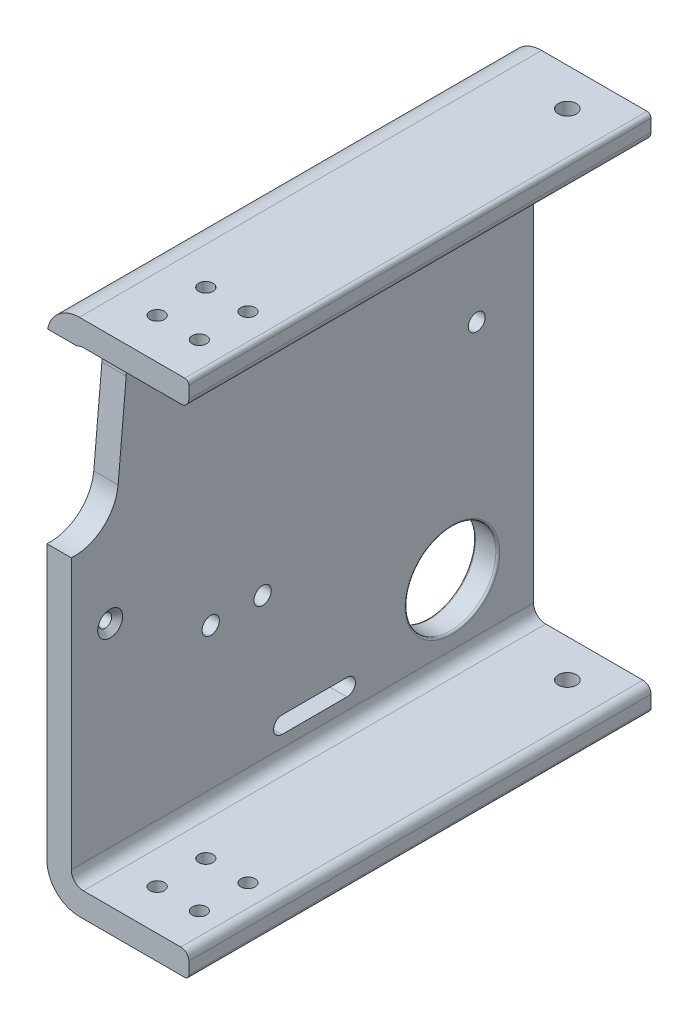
ISO-10303-21;
HEADER;
FILE_DESCRIPTION(('STEP AP214'),'2;1');
FILE_NAME('part.step','',(''),(''),'','','');
FILE_SCHEMA(('AUTOMOTIVE_DESIGN { 1 0 10303 214 1 1 1 1 }'));
ENDSEC;
DATA;
#1=APPLICATION_CONTEXT('core data for automotive mechanical design processes');
#2=APPLICATION_PROTOCOL_DEFINITION('international standard','automotive_design',2000,#1);
#3=PRODUCT_CONTEXT('',#1,'mechanical');
#4=PRODUCT('Part','Part','',(#3));
#5=PRODUCT_RELATED_PRODUCT_CATEGORY('part','',(#4));
#6=PRODUCT_DEFINITION_FORMATION('','',#4);
#7=PRODUCT_DEFINITION_CONTEXT('part definition',#1,'design');
#8=PRODUCT_DEFINITION('design','',#6,#7);
#9=PRODUCT_DEFINITION_SHAPE('','',#8);
#10=(LENGTH_UNIT() NAMED_UNIT(*) SI_UNIT(.MILLI.,.METRE.));
#11=(NAMED_UNIT(*) PLANE_ANGLE_UNIT() SI_UNIT($,.RADIAN.));
#12=(NAMED_UNIT(*) SI_UNIT($,.STERADIAN.) SOLID_ANGLE_UNIT());
#13=UNCERTAINTY_MEASURE_WITH_UNIT(LENGTH_MEASURE(1.E-05),#10,'distance_accuracy_value','');
#14=(GEOMETRIC_REPRESENTATION_CONTEXT(3) GLOBAL_UNCERTAINTY_ASSIGNED_CONTEXT((#13)) GLOBAL_UNIT_ASSIGNED_CONTEXT((#10,
#11,#12)) REPRESENTATION_CONTEXT('',''));
#15=CARTESIAN_POINT('',(0.,0.,0.));
#16=DIRECTION('',(0.,0.,1.));
#17=DIRECTION('',(1.,0.,0.));
#18=AXIS2_PLACEMENT_3D('',#15,#16,#17);
#19=CARTESIAN_POINT('',(12.6999999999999,88.8999999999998,180.975));
#20=DIRECTION('',(0.,0.,1.));
#21=DIRECTION('',(1.,0.,0.));
#22=AXIS2_PLACEMENT_3D('',#19,#20,#21);
#23=PLANE('',#22);
#24=DIRECTION('',(1.,0.,0.));
#25=VECTOR('',#24,1.);
#26=CARTESIAN_POINT('',(0.,18.4621017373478,180.975));
#27=LINE('',#26,#25);
#28=CARTESIAN_POINT('',(0.,18.4621017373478,180.975));
#29=VERTEX_POINT('',#28);
#30=CARTESIAN_POINT('',(9.52500000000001,18.4621017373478,180.975));
#31=VERTEX_POINT('',#30);
#32=EDGE_CURVE('E41',#29,#31,#27,.T.);
#33=ORIENTED_EDGE('',*,*,#32,.F.);
#34=DIRECTION('',(0.,-1.,0.));
#35=VECTOR('',#34,1.);
#36=CARTESIAN_POINT('',(0.,-88.9000000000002,180.975));
#37=LINE('',#36,#35);
#38=CARTESIAN_POINT('',(0.,-88.9000000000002,180.975));
#39=VERTEX_POINT('',#38);
#40=EDGE_CURVE('E242',#29,#39,#37,.T.);
#41=ORIENTED_EDGE('',*,*,#40,.T.);
#42=CARTESIAN_POINT('',(12.6999999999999,-88.9000000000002,180.975));
#43=DIRECTION('',(0.,0.,1.));
#44=DIRECTION('',(1.,0.,0.));
#45=AXIS2_PLACEMENT_3D('',#42,#43,#44);
#46=CIRCLE('',#45,12.7);
#47=CARTESIAN_POINT('',(12.7,-101.6,180.975));
#48=VERTEX_POINT('',#47);
#49=EDGE_CURVE('E437',#39,#48,#46,.T.);
#50=ORIENTED_EDGE('',*,*,#49,.T.);
#51=DIRECTION('',(1.,0.,0.));
#52=VECTOR('',#51,1.);
#53=CARTESIAN_POINT('',(53.9749999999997,-101.6,180.975));
#54=LINE('',#53,#52);
#55=CARTESIAN_POINT('',(53.9749999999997,-101.6,180.975));
#56=VERTEX_POINT('',#55);
#57=EDGE_CURVE('E439',#48,#56,#54,.T.);
#58=ORIENTED_EDGE('',*,*,#57,.T.);
#59=CARTESIAN_POINT('',(53.9749999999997,-100.0125,180.975));
#60=DIRECTION('',(0.,0.,1.));
#61=DIRECTION('',(-1.,0.,0.));
#62=AXIS2_PLACEMENT_3D('',#59,#60,#61);
#63=CIRCLE('',#62,1.5875);
#64=CARTESIAN_POINT('',(55.5624999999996,-100.0125,180.975));
#65=VERTEX_POINT('',#64);
#66=EDGE_CURVE('E441',#56,#65,#63,.T.);
#67=ORIENTED_EDGE('',*,*,#66,.T.);
#68=DIRECTION('',(0.,1.,0.));
#69=VECTOR('',#68,1.);
#70=CARTESIAN_POINT('',(55.5625000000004,-95.2500000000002,180.975));
#71=LINE('',#70,#69);
#72=CARTESIAN_POINT('',(55.5625000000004,-95.2500000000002,180.975));
#73=VERTEX_POINT('',#72);
#74=EDGE_CURVE('E443',#65,#73,#71,.T.);
#75=ORIENTED_EDGE('',*,*,#74,.T.);
#76=CARTESIAN_POINT('',(52.3875000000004,-95.2500000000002,180.975));
#77=DIRECTION('',(0.,0.,1.));
#78=DIRECTION('',(1.,0.,0.));
#79=AXIS2_PLACEMENT_3D('',#76,#77,#78);
#80=CIRCLE('',#79,3.17499999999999);
#81=CARTESIAN_POINT('',(52.3874999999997,-92.0750000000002,180.975));
#82=VERTEX_POINT('',#81);
#83=EDGE_CURVE('E445',#73,#82,#80,.T.);
#84=ORIENTED_EDGE('',*,*,#83,.T.);
#85=DIRECTION('',(-1.,0.,0.));
#86=VECTOR('',#85,1.);
#87=CARTESIAN_POINT('',(14.2875,-92.0750000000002,180.975));
#88=LINE('',#87,#86);
#89=CARTESIAN_POINT('',(14.2875,-92.0750000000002,180.975));
#90=VERTEX_POINT('',#89);
#91=EDGE_CURVE('E447',#82,#90,#88,.T.);
#92=ORIENTED_EDGE('',*,*,#91,.T.);
#93=CARTESIAN_POINT('',(14.2875000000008,-87.3125000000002,180.975));
#94=DIRECTION('',(0.,0.,-1.));
#95=DIRECTION('',(1.,0.,0.));
#96=AXIS2_PLACEMENT_3D('',#93,#94,#95);
#97=CIRCLE('',#96,4.7625);
#98=CARTESIAN_POINT('',(9.52500000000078,-87.3125000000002,180.975));
#99=VERTEX_POINT('',#98);
#100=EDGE_CURVE('E449',#90,#99,#97,.T.);
#101=ORIENTED_EDGE('',*,*,#100,.T.);
#102=DIRECTION('',(0.,1.,0.));
#103=VECTOR('',#102,1.);
#104=CARTESIAN_POINT('',(9.52500000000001,87.3124999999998,180.975));
#105=LINE('',#104,#103);
#106=EDGE_CURVE('E451',#99,#31,#105,.T.);
#107=ORIENTED_EDGE('',*,*,#106,.T.);
#108=EDGE_LOOP('',(#33,#41,#50,#58,#67,#75,#84,#92,#101,#107));
#109=FACE_BOUND('',#108,.T.);
#110=ADVANCED_FACE('F32',(#109),#23,.T.);
#111=CARTESIAN_POINT('',(12.6999999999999,88.8999999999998,180.975));
#112=DIRECTION('',(0.,0.,-1.));
#113=DIRECTION('',(-1.,0.,0.));
#114=AXIS2_PLACEMENT_3D('',#111,#112,#113);
#115=CYLINDRICAL_SURFACE('',#114,12.7);
#116=DIRECTION('',(0.,0.,-1.));
#117=VECTOR('',#116,1.);
#118=CARTESIAN_POINT('',(0.,88.8999999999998,180.975));
#119=LINE('',#118,#117);
#120=CARTESIAN_POINT('',(-1.11022302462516E-13,88.8999999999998,169.867622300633));
#121=VERTEX_POINT('',#120);
#122=CARTESIAN_POINT('',(0.,88.8999999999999,0.));
#123=VERTEX_POINT('',#122);
#124=EDGE_CURVE('E510',#121,#123,#119,.T.);
#125=ORIENTED_EDGE('',*,*,#124,.F.);
#126=CARTESIAN_POINT('',(0.,88.8999999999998,169.867622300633));
#127=CARTESIAN_POINT('',(8.80023197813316E-06,89.0318256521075,170.105875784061));
#128=CARTESIAN_POINT('',(0.00205266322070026,89.1588496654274,170.34677029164));
#129=CARTESIAN_POINT('',(0.009378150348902,89.4030917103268,170.833414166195));
#130=CARTESIAN_POINT('',(0.0146595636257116,89.5203103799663,171.079163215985));
#131=CARTESIAN_POINT('',(0.0276276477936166,89.7447500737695,171.575106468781));
#132=CARTESIAN_POINT('',(0.0353141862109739,89.8519716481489,171.825300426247));
#133=CARTESIAN_POINT('',(0.0523298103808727,90.0562583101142,172.329731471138));
#134=CARTESIAN_POINT('',(0.0616589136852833,90.1533232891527,172.583968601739));
#135=CARTESIAN_POINT('',(0.090588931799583,90.4249719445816,173.340773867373));
#136=CARTESIAN_POINT('',(0.111489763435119,90.5850418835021,173.848587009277));
#137=CARTESIAN_POINT('',(0.152111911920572,90.8648182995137,174.875138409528));
#138=CARTESIAN_POINT('',(0.171833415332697,90.9845311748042,175.393874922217));
#139=CARTESIAN_POINT('',(0.202807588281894,91.1619499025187,176.328798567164));
#140=CARTESIAN_POINT('',(0.214969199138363,91.2274126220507,176.743497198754));
#141=CARTESIAN_POINT('',(0.235023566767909,91.3325389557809,177.57620764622));
#142=CARTESIAN_POINT('',(0.242916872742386,91.3722058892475,177.994219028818));
#143=CARTESIAN_POINT('',(0.253721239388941,91.4260505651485,178.839448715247));
#144=CARTESIAN_POINT('',(0.256541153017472,91.4397622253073,179.266698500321));
#145=CARTESIAN_POINT('',(0.256616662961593,91.4401143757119,179.907566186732));
#146=CARTESIAN_POINT('',(0.255948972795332,91.4368602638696,180.121223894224));
#147=CARTESIAN_POINT('',(0.253258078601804,91.4236166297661,180.548322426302));
#148=CARTESIAN_POINT('',(0.251234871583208,91.4136270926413,180.76176325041));
#149=CARTESIAN_POINT('',(0.248549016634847,91.4002736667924,180.975));
#150=B_SPLINE_CURVE_WITH_KNOTS('',3,(#126,#127,#128,#129,#130,#131,#132,#133,#134,#135,#136,
#137,#138,#139,#140,#141,#142,#143,#144,#145,#146,#147,#148,#149),.UNSPECIFIED.,.F.,.F.,(4,2,2,
2,2,2,2,2,2,2,2,4),(0.,0.81679165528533,1.63353011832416,2.4502236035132,3.26692581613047,
4.86371796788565,6.46025684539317,7.71949088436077,8.97856285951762,10.2600372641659,
10.9009923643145,11.5419488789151),.UNSPECIFIED.);
#151=CARTESIAN_POINT('',(0.248549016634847,91.4002736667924,180.975));
#152=VERTEX_POINT('',#151);
#153=EDGE_CURVE('E274',#121,#152,#150,.T.);
#154=ORIENTED_EDGE('',*,*,#153,.T.);
#155=CARTESIAN_POINT('',(12.6999999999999,88.8999999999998,180.975));
#156=DIRECTION('',(0.,0.,1.));
#157=DIRECTION('',(1.,0.,0.));
#158=AXIS2_PLACEMENT_3D('',#155,#156,#157);
#159=CIRCLE('',#158,12.7);
#160=CARTESIAN_POINT('',(12.7,101.6,180.975));
#161=VERTEX_POINT('',#160);
#162=EDGE_CURVE('E433',#161,#152,#159,.T.);
#163=ORIENTED_EDGE('',*,*,#162,.F.);
#164=DIRECTION('',(0.,0.,-1.));
#165=VECTOR('',#164,1.);
#166=CARTESIAN_POINT('',(12.7,101.6,180.975));
#167=LINE('',#166,#165);
#168=CARTESIAN_POINT('',(12.7000000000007,101.6,-1.94289029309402E-13));
#169=VERTEX_POINT('',#168);
#170=EDGE_CURVE('E466',#161,#169,#167,.T.);
#171=ORIENTED_EDGE('',*,*,#170,.T.);
#172=CARTESIAN_POINT('',(12.6999999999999,88.8999999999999,-1.94289029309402E-13));
#173=DIRECTION('',(0.,0.,1.));
#174=DIRECTION('',(1.,0.,0.));
#175=AXIS2_PLACEMENT_3D('',#172,#173,#174);
#176=CIRCLE('',#175,12.7);
#177=EDGE_CURVE('E399',#169,#123,#176,.T.);
#178=ORIENTED_EDGE('',*,*,#177,.T.);
#179=EDGE_LOOP('',(#125,#154,#163,#171,#178));
#180=FACE_BOUND('',#179,.T.);
#181=ADVANCED_FACE('F34',(#180),#115,.T.);
#182=CARTESIAN_POINT('',(0.,-88.9000000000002,180.975));
#183=DIRECTION('',(1.,0.,0.));
#184=DIRECTION('',(0.,1.,0.));
#185=AXIS2_PLACEMENT_3D('',#182,#183,#184);
#186=PLANE('',#185);
#187=CARTESIAN_POINT('',(6.66133814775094E-13,-31.7500000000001,106.045));
#188=DIRECTION('',(1.,0.,0.));
#189=DIRECTION('',(0.,1.,0.));
#190=AXIS2_PLACEMENT_3D('',#187,#188,#189);
#191=CIRCLE('',#190,3.37819999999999);
#192=CARTESIAN_POINT('',(6.65902656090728E-13,-28.3718000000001,106.045));
#193=VERTEX_POINT('',#192);
#194=EDGE_CURVE('E1029',#193,#193,#191,.T.);
#195=ORIENTED_EDGE('',*,*,#194,.T.);
#196=EDGE_LOOP('',(#195));
#197=FACE_BOUND('',#196,.T.);
#198=CARTESIAN_POINT('',(-1.11022302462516E-13,-31.7500000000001,126.365));
#199=DIRECTION('',(1.,0.,0.));
#200=DIRECTION('',(0.,1.,0.));
#201=AXIS2_PLACEMENT_3D('',#198,#199,#200);
#202=CIRCLE('',#201,3.37819999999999);
#203=CARTESIAN_POINT('',(-1.11253461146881E-13,-28.3718000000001,126.365));
#204=VERTEX_POINT('',#203);
#205=EDGE_CURVE('E243',#204,#204,#202,.T.);
#206=ORIENTED_EDGE('',*,*,#205,.T.);
#207=EDGE_LOOP('',(#206));
#208=FACE_BOUND('',#207,.T.);
#209=ORIENTED_EDGE('',*,*,#40,.F.);
#210=CARTESIAN_POINT('',(-1.11022302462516E-13,35.5599999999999,179.705));
#211=DIRECTION('',(1.,0.,0.));
#212=DIRECTION('',(0.,1.,0.));
#213=AXIS2_PLACEMENT_3D('',#210,#211,#212);
#214=CIRCLE('',#213,17.145);
#215=CARTESIAN_POINT('',(0.,34.0291964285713,162.628476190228));
#216=VERTEX_POINT('',#215);
#217=EDGE_CURVE('E222',#29,#216,#214,.T.);
#218=ORIENTED_EDGE('',*,*,#217,.T.);
#219=DIRECTION('',(0.,0.996006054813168,-0.0892857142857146));
#220=VECTOR('',#219,1.);
#221=CARTESIAN_POINT('',(-1.11022302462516E-13,69.3057142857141,159.466156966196));
#222=LINE('',#221,#220);
#223=CARTESIAN_POINT('',(-1.11022302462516E-13,69.3057142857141,159.466156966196));
#224=VERTEX_POINT('',#223);
#225=EDGE_CURVE('E231',#216,#224,#222,.T.);
#226=ORIENTED_EDGE('',*,*,#225,.T.);
#227=CARTESIAN_POINT('',(6.66133814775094E-13,71.1199999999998,179.705));
#228=DIRECTION('',(1.,0.,0.));
#229=DIRECTION('',(0.,1.,0.));
#230=AXIS2_PLACEMENT_3D('',#227,#228,#229);
#231=CIRCLE('',#230,20.32);
#232=EDGE_CURVE('E228',#224,#121,#231,.T.);
#233=ORIENTED_EDGE('',*,*,#232,.T.);
#234=ORIENTED_EDGE('',*,*,#124,.T.);
#235=DIRECTION('',(0.,-1.,0.));
#236=VECTOR('',#235,1.);
#237=CARTESIAN_POINT('',(0.,-88.9000000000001,0.));
#238=LINE('',#237,#236);
#239=CARTESIAN_POINT('',(0.,-88.9000000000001,0.));
#240=VERTEX_POINT('',#239);
#241=EDGE_CURVE('E402',#123,#240,#238,.T.);
#242=ORIENTED_EDGE('',*,*,#241,.T.);
#243=DIRECTION('',(0.,0.,-1.));
#244=VECTOR('',#243,1.);
#245=CARTESIAN_POINT('',(0.,-88.9000000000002,180.975));
#246=LINE('',#245,#244);
#247=EDGE_CURVE('E507',#39,#240,#246,.T.);
#248=ORIENTED_EDGE('',*,*,#247,.F.);
#249=EDGE_LOOP('',(#209,#218,#226,#233,#234,#242,#248));
#250=FACE_BOUND('',#249,.T.);
#251=CARTESIAN_POINT('',(-1.11022302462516E-13,-11.4300000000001,165.735));
#252=DIRECTION('',(1.,0.,0.));
#253=DIRECTION('',(0.,0.,-1.));
#254=AXIS2_PLACEMENT_3D('',#251,#252,#253);
#255=CIRCLE('',#254,2.5527);
#256=CARTESIAN_POINT('',(-1.1102230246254E-13,-11.4300000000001,163.1823));
#257=VERTEX_POINT('',#256);
#258=EDGE_CURVE('E282',#257,#257,#255,.T.);
#259=ORIENTED_EDGE('',*,*,#258,.T.);
#260=EDGE_LOOP('',(#259));
#261=FACE_BOUND('',#260,.T.);
#262=CARTESIAN_POINT('',(0.,-63.5000000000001,31.75));
#263=DIRECTION('',(1.,0.,0.));
#264=DIRECTION('',(0.,1.,0.));
#265=AXIS2_PLACEMENT_3D('',#262,#263,#264);
#266=CIRCLE('',#265,18.542);
#267=CARTESIAN_POINT('',(0.,-44.9580000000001,31.75));
#268=VERTEX_POINT('',#267);
#269=EDGE_CURVE('E547',#268,#268,#266,.T.);
#270=ORIENTED_EDGE('',*,*,#269,.T.);
#271=EDGE_LOOP('',(#270));
#272=FACE_BOUND('',#271,.T.);
#273=CARTESIAN_POINT('',(0.,69.8499999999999,50.7999999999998));
#274=DIRECTION('',(-1.,0.,0.));
#275=DIRECTION('',(0.,-1.,0.));
#276=AXIS2_PLACEMENT_3D('',#273,#274,#275);
#277=CIRCLE('',#276,13.97);
#278=CARTESIAN_POINT('',(0.,55.8799999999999,50.7999999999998));
#279=VERTEX_POINT('',#278);
#280=EDGE_CURVE('E315',#279,#279,#277,.T.);
#281=ORIENTED_EDGE('',*,*,#280,.F.);
#282=EDGE_LOOP('',(#281));
#283=FACE_BOUND('',#282,.T.);
#284=DIRECTION('',(0.,0.,1.));
#285=VECTOR('',#284,1.);
#286=CARTESIAN_POINT('',(1.11022302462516E-13,-82.6897000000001,98.4249999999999));
#287=LINE('',#286,#285);
#288=CARTESIAN_POINT('',(0.,-82.6897000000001,73.0249999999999));
#289=VERTEX_POINT('',#288);
#290=CARTESIAN_POINT('',(1.11022302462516E-13,-82.6897000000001,98.4249999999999));
#291=VERTEX_POINT('',#290);
#292=EDGE_CURVE('E332',#289,#291,#287,.T.);
#293=ORIENTED_EDGE('',*,*,#292,.F.);
#294=CARTESIAN_POINT('',(0.,-79.3750000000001,73.0249999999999));
#295=DIRECTION('',(-1.,0.,0.));
#296=DIRECTION('',(0.,1.,0.));
#297=AXIS2_PLACEMENT_3D('',#294,#295,#296);
#298=CIRCLE('',#297,3.3147);
#299=CARTESIAN_POINT('',(0.,-76.0603000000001,73.0249999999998));
#300=VERTEX_POINT('',#299);
#301=EDGE_CURVE('E56',#300,#289,#298,.T.);
#302=ORIENTED_EDGE('',*,*,#301,.F.);
#303=DIRECTION('',(0.,0.,-1.));
#304=VECTOR('',#303,1.);
#305=CARTESIAN_POINT('',(0.,-76.0603000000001,98.4249999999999));
#306=LINE('',#305,#304);
#307=CARTESIAN_POINT('',(0.,-76.0603000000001,98.4249999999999));
#308=VERTEX_POINT('',#307);
#309=EDGE_CURVE('E338',#308,#300,#306,.T.);
#310=ORIENTED_EDGE('',*,*,#309,.F.);
#311=CARTESIAN_POINT('',(7.7715611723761E-13,-79.3750000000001,98.425));
#312=DIRECTION('',(-1.,0.,0.));
#313=DIRECTION('',(0.,-1.,0.));
#314=AXIS2_PLACEMENT_3D('',#311,#312,#313);
#315=CIRCLE('',#314,3.31470000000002);
#316=EDGE_CURVE('E335',#291,#308,#315,.T.);
#317=ORIENTED_EDGE('',*,*,#316,.F.);
#318=EDGE_LOOP('',(#293,#302,#310,#317));
#319=FACE_BOUND('',#318,.T.);
#320=DIRECTION('',(0.,0.,-1.));
#321=VECTOR('',#320,1.);
#322=CARTESIAN_POINT('',(0.,82.6896999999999,98.4249999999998));
#323=LINE('',#322,#321);
#324=CARTESIAN_POINT('',(0.,82.6896999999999,98.4249999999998));
#325=VERTEX_POINT('',#324);
#326=CARTESIAN_POINT('',(6.66133814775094E-13,82.6896999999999,73.0249999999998));
#327=VERTEX_POINT('',#326);
#328=EDGE_CURVE('E351',#325,#327,#323,.T.);
#329=ORIENTED_EDGE('',*,*,#328,.F.);
#330=CARTESIAN_POINT('',(0.,79.3749999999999,98.4249999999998));
#331=DIRECTION('',(-1.,0.,0.));
#332=DIRECTION('',(0.,-1.,0.));
#333=AXIS2_PLACEMENT_3D('',#330,#331,#332);
#334=CIRCLE('',#333,3.31470000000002);
#335=CARTESIAN_POINT('',(0.,76.0602999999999,98.4249999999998));
#336=VERTEX_POINT('',#335);
#337=EDGE_CURVE('E344',#336,#325,#334,.T.);
#338=ORIENTED_EDGE('',*,*,#337,.F.);
#339=DIRECTION('',(0.,0.,1.));
#340=VECTOR('',#339,1.);
#341=CARTESIAN_POINT('',(0.,76.0602999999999,98.4249999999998));
#342=LINE('',#341,#340);
#343=CARTESIAN_POINT('',(0.,76.0602999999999,73.0249999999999));
#344=VERTEX_POINT('',#343);
#345=EDGE_CURVE('E357',#344,#336,#342,.T.);
#346=ORIENTED_EDGE('',*,*,#345,.F.);
#347=CARTESIAN_POINT('',(0.,79.3749999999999,73.0249999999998));
#348=DIRECTION('',(-1.,0.,0.));
#349=DIRECTION('',(0.,-1.,0.));
#350=AXIS2_PLACEMENT_3D('',#347,#348,#349);
#351=CIRCLE('',#350,3.3147);
#352=EDGE_CURVE('E354',#327,#344,#351,.T.);
#353=ORIENTED_EDGE('',*,*,#352,.F.);
#354=EDGE_LOOP('',(#329,#338,#346,#353));
#355=FACE_BOUND('',#354,.T.);
#356=CARTESIAN_POINT('',(0.,19.05,22.225));
#357=DIRECTION('',(1.,0.,0.));
#358=DIRECTION('',(0.,1.,0.));
#359=AXIS2_PLACEMENT_3D('',#356,#357,#358);
#360=CIRCLE('',#359,3.3147);
#361=CARTESIAN_POINT('',(0.,22.3647,22.225));
#362=VERTEX_POINT('',#361);
#363=EDGE_CURVE('E372',#362,#362,#360,.T.);
#364=ORIENTED_EDGE('',*,*,#363,.T.);
#365=EDGE_LOOP('',(#364));
#366=FACE_BOUND('',#365,.T.);
#367=ADVANCED_FACE('F239',(#197,#208,#250,#261,#272,#283,#319,#355,#366),#186,.F.);
#368=CARTESIAN_POINT('',(12.6999999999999,-88.9000000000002,180.975));
#369=DIRECTION('',(0.,0.,-1.));
#370=DIRECTION('',(-1.,0.,0.));
#371=AXIS2_PLACEMENT_3D('',#368,#369,#370);
#372=CYLINDRICAL_SURFACE('',#371,12.7);
#373=CARTESIAN_POINT('',(12.7,-88.9000000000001,0.));
#374=DIRECTION('',(0.,0.,1.));
#375=DIRECTION('',(1.,0.,0.));
#376=AXIS2_PLACEMENT_3D('',#373,#374,#375);
#377=CIRCLE('',#376,12.7);
#378=CARTESIAN_POINT('',(12.7,-101.6,0.));
#379=VERTEX_POINT('',#378);
#380=EDGE_CURVE('E404',#240,#379,#377,.T.);
#381=ORIENTED_EDGE('',*,*,#380,.T.);
#382=DIRECTION('',(0.,0.,-1.));
#383=VECTOR('',#382,1.);
#384=CARTESIAN_POINT('',(12.7,-101.6,180.975));
#385=LINE('',#384,#383);
#386=EDGE_CURVE('E504',#48,#379,#385,.T.);
#387=ORIENTED_EDGE('',*,*,#386,.F.);
#388=ORIENTED_EDGE('',*,*,#49,.F.);
#389=ORIENTED_EDGE('',*,*,#247,.T.);
#390=EDGE_LOOP('',(#381,#387,#388,#389));
#391=FACE_BOUND('',#390,.T.);
#392=ADVANCED_FACE('F594',(#391),#372,.T.);
#393=CARTESIAN_POINT('',(53.9749999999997,-101.6,180.975));
#394=DIRECTION('',(0.,1.,0.));
#395=DIRECTION('',(-1.,0.,0.));
#396=AXIS2_PLACEMENT_3D('',#393,#394,#395);
#397=PLANE('',#396);
#398=CARTESIAN_POINT('',(27.2832554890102,-101.6,165.1));
#399=DIRECTION('',(0.,1.,0.));
#400=DIRECTION('',(0.,0.,1.));
#401=AXIS2_PLACEMENT_3D('',#398,#399,#400);
#402=CIRCLE('',#401,2.8067);
#403=CARTESIAN_POINT('',(27.2832554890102,-101.6,167.9067));
#404=VERTEX_POINT('',#403);
#405=EDGE_CURVE('E294',#404,#404,#402,.T.);
#406=ORIENTED_EDGE('',*,*,#405,.T.);
#407=EDGE_LOOP('',(#406));
#408=FACE_BOUND('',#407,.T.);
#409=CARTESIAN_POINT('',(27.2832554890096,-101.6,146.05));
#410=DIRECTION('',(0.,1.,0.));
#411=DIRECTION('',(0.,0.,1.));
#412=AXIS2_PLACEMENT_3D('',#409,#410,#411);
#413=CIRCLE('',#412,2.8067);
#414=CARTESIAN_POINT('',(27.2832554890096,-101.6,148.8567));
#415=VERTEX_POINT('',#414);
#416=EDGE_CURVE('E306',#415,#415,#413,.T.);
#417=ORIENTED_EDGE('',*,*,#416,.T.);
#418=EDGE_LOOP('',(#417));
#419=FACE_BOUND('',#418,.T.);
#420=CARTESIAN_POINT('',(37.5285000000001,-101.6,14.732));
#421=DIRECTION('',(0.,1.,0.));
#422=DIRECTION('',(0.,0.,1.));
#423=AXIS2_PLACEMENT_3D('',#420,#421,#422);
#424=CIRCLE('',#423,3.556);
#425=CARTESIAN_POINT('',(37.5285000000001,-101.6,18.288));
#426=VERTEX_POINT('',#425);
#427=EDGE_CURVE('E322',#426,#426,#424,.T.);
#428=ORIENTED_EDGE('',*,*,#427,.T.);
#429=EDGE_LOOP('',(#428));
#430=FACE_BOUND('',#429,.T.);
#431=CARTESIAN_POINT('',(43.7932554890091,-101.6,146.05));
#432=DIRECTION('',(0.,1.,0.));
#433=DIRECTION('',(0.,0.,1.));
#434=AXIS2_PLACEMENT_3D('',#431,#432,#433);
#435=CIRCLE('',#434,2.794);
#436=CARTESIAN_POINT('',(43.7932554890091,-101.6,148.844));
#437=VERTEX_POINT('',#436);
#438=EDGE_CURVE('E378',#437,#437,#435,.T.);
#439=ORIENTED_EDGE('',*,*,#438,.T.);
#440=EDGE_LOOP('',(#439));
#441=FACE_BOUND('',#440,.T.);
#442=CARTESIAN_POINT('',(43.7932554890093,-101.6,165.1));
#443=DIRECTION('',(0.,1.,0.));
#444=DIRECTION('',(0.,0.,1.));
#445=AXIS2_PLACEMENT_3D('',#442,#443,#444);
#446=CIRCLE('',#445,2.794);
#447=CARTESIAN_POINT('',(43.7932554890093,-101.6,167.894));
#448=VERTEX_POINT('',#447);
#449=EDGE_CURVE('E390',#448,#448,#446,.T.);
#450=ORIENTED_EDGE('',*,*,#449,.T.);
#451=EDGE_LOOP('',(#450));
#452=FACE_BOUND('',#451,.T.);
#453=DIRECTION('',(1.,0.,0.));
#454=VECTOR('',#453,1.);
#455=CARTESIAN_POINT('',(53.9749999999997,-101.6,0.));
#456=LINE('',#455,#454);
#457=CARTESIAN_POINT('',(53.9749999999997,-101.6,0.));
#458=VERTEX_POINT('',#457);
#459=EDGE_CURVE('E406',#379,#458,#456,.T.);
#460=ORIENTED_EDGE('',*,*,#459,.T.);
#461=DIRECTION('',(0.,0.,-1.));
#462=VECTOR('',#461,1.);
#463=CARTESIAN_POINT('',(53.9749999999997,-101.6,180.975));
#464=LINE('',#463,#462);
#465=EDGE_CURVE('E501',#56,#458,#464,.T.);
#466=ORIENTED_EDGE('',*,*,#465,.F.);
#467=ORIENTED_EDGE('',*,*,#57,.F.);
#468=ORIENTED_EDGE('',*,*,#386,.T.);
#469=EDGE_LOOP('',(#460,#466,#467,#468));
#470=FACE_BOUND('',#469,.T.);
#471=ADVANCED_FACE('F601',(#408,#419,#430,#441,#452,#470),#397,.F.);
#472=CARTESIAN_POINT('',(53.9749999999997,-100.0125,180.975));
#473=DIRECTION('',(0.,0.,-1.));
#474=DIRECTION('',(-1.,0.,0.));
#475=AXIS2_PLACEMENT_3D('',#472,#473,#474);
#476=CYLINDRICAL_SURFACE('',#475,1.5875);
#477=CARTESIAN_POINT('',(53.9749999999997,-100.0125,0.));
#478=DIRECTION('',(0.,0.,1.));
#479=DIRECTION('',(-1.,0.,0.));
#480=AXIS2_PLACEMENT_3D('',#477,#478,#479);
#481=CIRCLE('',#480,1.5875);
#482=CARTESIAN_POINT('',(55.5624999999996,-100.0125,0.));
#483=VERTEX_POINT('',#482);
#484=EDGE_CURVE('E408',#458,#483,#481,.T.);
#485=ORIENTED_EDGE('',*,*,#484,.T.);
#486=DIRECTION('',(0.,0.,-1.));
#487=VECTOR('',#486,1.);
#488=CARTESIAN_POINT('',(55.5624999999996,-100.0125,180.975));
#489=LINE('',#488,#487);
#490=EDGE_CURVE('E498',#65,#483,#489,.T.);
#491=ORIENTED_EDGE('',*,*,#490,.F.);
#492=ORIENTED_EDGE('',*,*,#66,.F.);
#493=ORIENTED_EDGE('',*,*,#465,.T.);
#494=EDGE_LOOP('',(#485,#491,#492,#493));
#495=FACE_BOUND('',#494,.T.);
#496=ADVANCED_FACE('F604',(#495),#476,.T.);
#497=CARTESIAN_POINT('',(55.5625000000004,-95.2500000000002,180.975));
#498=DIRECTION('',(-1.,0.,0.));
#499=DIRECTION('',(0.,-1.,0.));
#500=AXIS2_PLACEMENT_3D('',#497,#498,#499);
#501=PLANE('',#500);
#502=DIRECTION('',(0.,1.,0.));
#503=VECTOR('',#502,1.);
#504=CARTESIAN_POINT('',(55.5625000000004,-95.2500000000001,0.));
#505=LINE('',#504,#503);
#506=CARTESIAN_POINT('',(55.5625000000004,-95.2500000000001,0.));
#507=VERTEX_POINT('',#506);
#508=EDGE_CURVE('E410',#483,#507,#505,.T.);
#509=ORIENTED_EDGE('',*,*,#508,.T.);
#510=DIRECTION('',(0.,0.,-1.));
#511=VECTOR('',#510,1.);
#512=CARTESIAN_POINT('',(55.5625000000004,-95.2500000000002,180.975));
#513=LINE('',#512,#511);
#514=EDGE_CURVE('E495',#73,#507,#513,.T.);
#515=ORIENTED_EDGE('',*,*,#514,.F.);
#516=ORIENTED_EDGE('',*,*,#74,.F.);
#517=ORIENTED_EDGE('',*,*,#490,.T.);
#518=EDGE_LOOP('',(#509,#515,#516,#517));
#519=FACE_BOUND('',#518,.T.);
#520=ADVANCED_FACE('F609',(#519),#501,.F.);
#521=CARTESIAN_POINT('',(52.3875000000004,-95.2500000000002,180.975));
#522=DIRECTION('',(0.,0.,-1.));
#523=DIRECTION('',(-1.,0.,0.));
#524=AXIS2_PLACEMENT_3D('',#521,#522,#523);
#525=CYLINDRICAL_SURFACE('',#524,3.17499999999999);
#526=CARTESIAN_POINT('',(52.3875000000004,-95.2500000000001,0.));
#527=DIRECTION('',(0.,0.,1.));
#528=DIRECTION('',(1.,0.,0.));
#529=AXIS2_PLACEMENT_3D('',#526,#527,#528);
#530=CIRCLE('',#529,3.17499999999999);
#531=CARTESIAN_POINT('',(52.3874999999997,-92.0750000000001,0.));
#532=VERTEX_POINT('',#531);
#533=EDGE_CURVE('E412',#507,#532,#530,.T.);
#534=ORIENTED_EDGE('',*,*,#533,.T.);
#535=DIRECTION('',(0.,0.,-1.));
#536=VECTOR('',#535,1.);
#537=CARTESIAN_POINT('',(52.3874999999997,-92.0750000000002,180.975));
#538=LINE('',#537,#536);
#539=EDGE_CURVE('E492',#82,#532,#538,.T.);
#540=ORIENTED_EDGE('',*,*,#539,.F.);
#541=ORIENTED_EDGE('',*,*,#83,.F.);
#542=ORIENTED_EDGE('',*,*,#514,.T.);
#543=EDGE_LOOP('',(#534,#540,#541,#542));
#544=FACE_BOUND('',#543,.T.);
#545=ADVANCED_FACE('F613',(#544),#525,.T.);
#546=CARTESIAN_POINT('',(14.2875,-92.0750000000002,180.975));
#547=DIRECTION('',(0.,-1.,0.));
#548=DIRECTION('',(0.,0.,-1.));
#549=AXIS2_PLACEMENT_3D('',#546,#547,#548);
#550=PLANE('',#549);
#551=CARTESIAN_POINT('',(27.2832554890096,-92.0750000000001,165.1));
#552=DIRECTION('',(0.,-1.,0.));
#553=DIRECTION('',(0.,0.,-1.));
#554=AXIS2_PLACEMENT_3D('',#551,#552,#553);
#555=CIRCLE('',#554,2.8067);
#556=CARTESIAN_POINT('',(27.2832554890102,-92.0750000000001,167.9067));
#557=VERTEX_POINT('',#556);
#558=EDGE_CURVE('E300',#557,#557,#555,.T.);
#559=ORIENTED_EDGE('',*,*,#558,.T.);
#560=EDGE_LOOP('',(#559));
#561=FACE_BOUND('',#560,.T.);
#562=CARTESIAN_POINT('',(27.2832554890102,-92.0750000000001,146.05));
#563=DIRECTION('',(0.,-1.,0.));
#564=DIRECTION('',(0.,0.,-1.));
#565=AXIS2_PLACEMENT_3D('',#562,#563,#564);
#566=CIRCLE('',#565,2.8067);
#567=CARTESIAN_POINT('',(27.2832554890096,-92.0750000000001,148.8567));
#568=VERTEX_POINT('',#567);
#569=EDGE_CURVE('E312',#568,#568,#566,.T.);
#570=ORIENTED_EDGE('',*,*,#569,.T.);
#571=EDGE_LOOP('',(#570));
#572=FACE_BOUND('',#571,.T.);
#573=CARTESIAN_POINT('',(37.5285000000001,-92.0750000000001,14.732));
#574=DIRECTION('',(0.,-1.,0.));
#575=DIRECTION('',(0.,0.,-1.));
#576=AXIS2_PLACEMENT_3D('',#573,#574,#575);
#577=CIRCLE('',#576,3.556);
#578=CARTESIAN_POINT('',(37.5285000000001,-92.0750000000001,18.288));
#579=VERTEX_POINT('',#578);
#580=EDGE_CURVE('E328',#579,#579,#577,.T.);
#581=ORIENTED_EDGE('',*,*,#580,.T.);
#582=EDGE_LOOP('',(#581));
#583=FACE_BOUND('',#582,.T.);
#584=CARTESIAN_POINT('',(43.7932554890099,-92.0750000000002,146.05));
#585=DIRECTION('',(0.,-1.,0.));
#586=DIRECTION('',(0.,0.,-1.));
#587=AXIS2_PLACEMENT_3D('',#584,#585,#586);
#588=CIRCLE('',#587,2.794);
#589=CARTESIAN_POINT('',(43.7932554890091,-92.0750000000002,148.844));
#590=VERTEX_POINT('',#589);
#591=EDGE_CURVE('E384',#590,#590,#588,.T.);
#592=ORIENTED_EDGE('',*,*,#591,.T.);
#593=EDGE_LOOP('',(#592));
#594=FACE_BOUND('',#593,.T.);
#595=CARTESIAN_POINT('',(43.7932554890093,-92.0750000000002,165.1));
#596=DIRECTION('',(0.,-1.,0.));
#597=DIRECTION('',(0.,0.,-1.));
#598=AXIS2_PLACEMENT_3D('',#595,#596,#597);
#599=CIRCLE('',#598,2.794);
#600=CARTESIAN_POINT('',(43.7932554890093,-92.0750000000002,167.894));
#601=VERTEX_POINT('',#600);
#602=EDGE_CURVE('E396',#601,#601,#599,.T.);
#603=ORIENTED_EDGE('',*,*,#602,.T.);
#604=EDGE_LOOP('',(#603));
#605=FACE_BOUND('',#604,.T.);
#606=DIRECTION('',(-1.,0.,0.));
#607=VECTOR('',#606,1.);
#608=CARTESIAN_POINT('',(14.2875,-92.0750000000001,0.));
#609=LINE('',#608,#607);
#610=CARTESIAN_POINT('',(14.2875,-92.0750000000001,0.));
#611=VERTEX_POINT('',#610);
#612=EDGE_CURVE('E414',#532,#611,#609,.T.);
#613=ORIENTED_EDGE('',*,*,#612,.T.);
#614=DIRECTION('',(0.,0.,-1.));
#615=VECTOR('',#614,1.);
#616=CARTESIAN_POINT('',(14.2875,-92.0750000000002,180.975));
#617=LINE('',#616,#615);
#618=EDGE_CURVE('E489',#90,#611,#617,.T.);
#619=ORIENTED_EDGE('',*,*,#618,.F.);
#620=ORIENTED_EDGE('',*,*,#91,.F.);
#621=ORIENTED_EDGE('',*,*,#539,.T.);
#622=EDGE_LOOP('',(#613,#619,#620,#621));
#623=FACE_BOUND('',#622,.T.);
#624=ADVANCED_FACE('F616',(#561,#572,#583,#594,#605,#623),#550,.F.);
#625=CARTESIAN_POINT('',(14.2875000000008,-87.3125000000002,180.975));
#626=DIRECTION('',(0.,0.,-1.));
#627=DIRECTION('',(-1.,0.,0.));
#628=AXIS2_PLACEMENT_3D('',#625,#626,#627);
#629=CYLINDRICAL_SURFACE('',#628,4.7625);
#630=CARTESIAN_POINT('',(14.2875000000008,-87.3125000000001,0.));
#631=DIRECTION('',(0.,0.,-1.));
#632=DIRECTION('',(1.,0.,0.));
#633=AXIS2_PLACEMENT_3D('',#630,#631,#632);
#634=CIRCLE('',#633,4.7625);
#635=CARTESIAN_POINT('',(9.52500000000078,-87.3125000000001,0.));
#636=VERTEX_POINT('',#635);
#637=EDGE_CURVE('E416',#611,#636,#634,.T.);
#638=ORIENTED_EDGE('',*,*,#637,.T.);
#639=DIRECTION('',(0.,0.,-1.));
#640=VECTOR('',#639,1.);
#641=CARTESIAN_POINT('',(9.52500000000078,-87.3125000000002,180.975));
#642=LINE('',#641,#640);
#643=EDGE_CURVE('E486',#99,#636,#642,.T.);
#644=ORIENTED_EDGE('',*,*,#643,.F.);
#645=ORIENTED_EDGE('',*,*,#100,.F.);
#646=ORIENTED_EDGE('',*,*,#618,.T.);
#647=EDGE_LOOP('',(#638,#644,#645,#646));
#648=FACE_BOUND('',#647,.T.);
#649=ADVANCED_FACE('F561',(#648),#629,.F.);
#650=CARTESIAN_POINT('',(9.52500000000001,87.3124999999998,180.975));
#651=DIRECTION('',(-1.,0.,0.));
#652=DIRECTION('',(0.,-1.,0.));
#653=AXIS2_PLACEMENT_3D('',#650,#651,#652);
#654=PLANE('',#653);
#655=CARTESIAN_POINT('',(9.52500000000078,-31.7500000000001,106.045));
#656=DIRECTION('',(1.,0.,0.));
#657=DIRECTION('',(0.,1.,0.));
#658=AXIS2_PLACEMENT_3D('',#655,#656,#657);
#659=CIRCLE('',#658,3.37819999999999);
#660=CARTESIAN_POINT('',(9.52500000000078,-28.3718000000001,106.045));
#661=VERTEX_POINT('',#660);
#662=EDGE_CURVE('E1032',#661,#661,#659,.T.);
#663=ORIENTED_EDGE('',*,*,#662,.F.);
#664=EDGE_LOOP('',(#663));
#665=FACE_BOUND('',#664,.T.);
#666=CARTESIAN_POINT('',(9.52500000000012,-31.7500000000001,126.365));
#667=DIRECTION('',(1.,0.,0.));
#668=DIRECTION('',(0.,1.,0.));
#669=AXIS2_PLACEMENT_3D('',#666,#667,#668);
#670=CIRCLE('',#669,3.37819999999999);
#671=CARTESIAN_POINT('',(9.52500000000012,-28.3718000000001,126.365));
#672=VERTEX_POINT('',#671);
#673=EDGE_CURVE('E246',#672,#672,#670,.T.);
#674=ORIENTED_EDGE('',*,*,#673,.F.);
#675=EDGE_LOOP('',(#674));
#676=FACE_BOUND('',#675,.T.);
#677=CARTESIAN_POINT('',(9.52500000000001,-11.4300000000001,165.735));
#678=DIRECTION('',(1.,0.,0.));
#679=DIRECTION('',(0.,0.,-1.));
#680=AXIS2_PLACEMENT_3D('',#677,#678,#679);
#681=CIRCLE('',#680,4.8895);
#682=CARTESIAN_POINT('',(9.52500000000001,-11.4300000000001,160.8455));
#683=VERTEX_POINT('',#682);
#684=EDGE_CURVE('E288',#683,#683,#681,.T.);
#685=ORIENTED_EDGE('',*,*,#684,.F.);
#686=EDGE_LOOP('',(#685));
#687=FACE_BOUND('',#686,.T.);
#688=CARTESIAN_POINT('',(9.52500000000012,-63.5000000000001,31.75));
#689=DIRECTION('',(-1.,0.,0.));
#690=DIRECTION('',(0.,-1.,0.));
#691=AXIS2_PLACEMENT_3D('',#688,#689,#690);
#692=CIRCLE('',#691,18.542);
#693=CARTESIAN_POINT('',(9.52500000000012,-82.0420000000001,31.75));
#694=VERTEX_POINT('',#693);
#695=EDGE_CURVE('E536',#694,#694,#692,.T.);
#696=ORIENTED_EDGE('',*,*,#695,.T.);
#697=EDGE_LOOP('',(#696));
#698=FACE_BOUND('',#697,.T.);
#699=CARTESIAN_POINT('',(9.52500000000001,69.8499999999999,50.7999999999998));
#700=DIRECTION('',(-1.,0.,0.));
#701=DIRECTION('',(0.,-1.,0.));
#702=AXIS2_PLACEMENT_3D('',#699,#700,#701);
#703=CIRCLE('',#702,13.97);
#704=CARTESIAN_POINT('',(9.52500000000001,55.8799999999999,50.7999999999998));
#705=VERTEX_POINT('',#704);
#706=EDGE_CURVE('E318',#705,#705,#703,.T.);
#707=ORIENTED_EDGE('',*,*,#706,.T.);
#708=EDGE_LOOP('',(#707));
#709=FACE_BOUND('',#708,.T.);
#710=DIRECTION('',(0.,0.,-1.));
#711=VECTOR('',#710,1.);
#712=CARTESIAN_POINT('',(9.52500000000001,-76.0603000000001,180.975));
#713=LINE('',#712,#711);
#714=CARTESIAN_POINT('',(9.52500000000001,-76.0603000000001,98.4249999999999));
#715=VERTEX_POINT('',#714);
#716=CARTESIAN_POINT('',(9.52500000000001,-76.0603000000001,73.0249999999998));
#717=VERTEX_POINT('',#716);
#718=EDGE_CURVE('E530',#715,#717,#713,.T.);
#719=ORIENTED_EDGE('',*,*,#718,.T.);
#720=CARTESIAN_POINT('',(9.52500000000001,-79.3750000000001,73.0249999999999));
#721=DIRECTION('',(-1.,0.,0.));
#722=DIRECTION('',(0.,-1.,0.));
#723=AXIS2_PLACEMENT_3D('',#720,#721,#722);
#724=CIRCLE('',#723,3.3147);
#725=CARTESIAN_POINT('',(9.52500000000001,-82.6897000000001,73.0249999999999));
#726=VERTEX_POINT('',#725);
#727=EDGE_CURVE('E533',#717,#726,#724,.T.);
#728=ORIENTED_EDGE('',*,*,#727,.T.);
#729=DIRECTION('',(0.,0.,1.));
#730=VECTOR('',#729,1.);
#731=CARTESIAN_POINT('',(9.52500000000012,-82.6897000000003,180.975));
#732=LINE('',#731,#730);
#733=CARTESIAN_POINT('',(9.52500000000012,-82.6897000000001,98.4249999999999));
#734=VERTEX_POINT('',#733);
#735=EDGE_CURVE('E524',#726,#734,#732,.T.);
#736=ORIENTED_EDGE('',*,*,#735,.T.);
#737=CARTESIAN_POINT('',(9.52500000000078,-79.3750000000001,98.425));
#738=DIRECTION('',(-1.,0.,0.));
#739=DIRECTION('',(0.,-1.,0.));
#740=AXIS2_PLACEMENT_3D('',#737,#738,#739);
#741=CIRCLE('',#740,3.31470000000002);
#742=EDGE_CURVE('E527',#734,#715,#741,.T.);
#743=ORIENTED_EDGE('',*,*,#742,.T.);
#744=EDGE_LOOP('',(#719,#728,#736,#743));
#745=FACE_BOUND('',#744,.T.);
#746=DIRECTION('',(0.,0.,1.));
#747=VECTOR('',#746,1.);
#748=CARTESIAN_POINT('',(9.52500000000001,76.0602999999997,180.975));
#749=LINE('',#748,#747);
#750=CARTESIAN_POINT('',(9.52500000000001,76.0602999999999,73.0249999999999));
#751=VERTEX_POINT('',#750);
#752=CARTESIAN_POINT('',(9.52500000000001,76.0602999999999,98.4249999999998));
#753=VERTEX_POINT('',#752);
#754=EDGE_CURVE('E518',#751,#753,#749,.T.);
#755=ORIENTED_EDGE('',*,*,#754,.T.);
#756=CARTESIAN_POINT('',(9.52500000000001,79.3749999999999,98.4249999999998));
#757=DIRECTION('',(-1.,0.,0.));
#758=DIRECTION('',(0.,-1.,0.));
#759=AXIS2_PLACEMENT_3D('',#756,#757,#758);
#760=CIRCLE('',#759,3.31470000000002);
#761=CARTESIAN_POINT('',(9.52500000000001,82.6896999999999,98.4249999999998));
#762=VERTEX_POINT('',#761);
#763=EDGE_CURVE('E521',#753,#762,#760,.T.);
#764=ORIENTED_EDGE('',*,*,#763,.T.);
#765=DIRECTION('',(0.,0.,-1.));
#766=VECTOR('',#765,1.);
#767=CARTESIAN_POINT('',(9.52500000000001,82.6896999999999,180.975));
#768=LINE('',#767,#766);
#769=CARTESIAN_POINT('',(9.52500000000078,82.6896999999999,73.0249999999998));
#770=VERTEX_POINT('',#769);
#771=EDGE_CURVE('E512',#762,#770,#768,.T.);
#772=ORIENTED_EDGE('',*,*,#771,.T.);
#773=CARTESIAN_POINT('',(9.52500000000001,79.3749999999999,73.0249999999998));
#774=DIRECTION('',(-1.,0.,0.));
#775=DIRECTION('',(0.,-1.,0.));
#776=AXIS2_PLACEMENT_3D('',#773,#774,#775);
#777=CIRCLE('',#776,3.3147);
#778=EDGE_CURVE('E515',#770,#751,#777,.T.);
#779=ORIENTED_EDGE('',*,*,#778,.T.);
#780=EDGE_LOOP('',(#755,#764,#772,#779));
#781=FACE_BOUND('',#780,.T.);
#782=CARTESIAN_POINT('',(9.52500000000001,19.05,22.225));
#783=DIRECTION('',(1.,0.,0.));
#784=DIRECTION('',(0.,1.,0.));
#785=AXIS2_PLACEMENT_3D('',#782,#783,#784);
#786=CIRCLE('',#785,3.3147);
#787=CARTESIAN_POINT('',(9.52500000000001,22.3647,22.225));
#788=VERTEX_POINT('',#787);
#789=EDGE_CURVE('E363',#788,#788,#786,.T.);
#790=ORIENTED_EDGE('',*,*,#789,.F.);
#791=EDGE_LOOP('',(#790));
#792=FACE_BOUND('',#791,.T.);
#793=DIRECTION('',(0.,-0.996006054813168,0.0892857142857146));
#794=VECTOR('',#793,1.);
#795=CARTESIAN_POINT('',(9.52500000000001,85.2561886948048,158.036296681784));
#796=LINE('',#795,#794);
#797=CARTESIAN_POINT('',(9.52500000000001,69.3057142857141,159.466156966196));
#798=VERTEX_POINT('',#797);
#799=CARTESIAN_POINT('',(9.52500000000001,34.0291964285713,162.628476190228));
#800=VERTEX_POINT('',#799);
#801=EDGE_CURVE('E11',#798,#800,#796,.T.);
#802=ORIENTED_EDGE('',*,*,#801,.T.);
#803=CARTESIAN_POINT('',(9.52500000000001,35.5599999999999,179.705));
#804=DIRECTION('',(-1.,0.,0.));
#805=DIRECTION('',(0.,-1.,0.));
#806=AXIS2_PLACEMENT_3D('',#803,#804,#805);
#807=CIRCLE('',#806,17.145);
#808=EDGE_CURVE('E225',#800,#31,#807,.T.);
#809=ORIENTED_EDGE('',*,*,#808,.T.);
#810=ORIENTED_EDGE('',*,*,#106,.F.);
#811=ORIENTED_EDGE('',*,*,#643,.T.);
#812=DIRECTION('',(0.,1.,0.));
#813=VECTOR('',#812,1.);
#814=CARTESIAN_POINT('',(9.52500000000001,87.3124999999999,-1.94289029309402E-13));
#815=LINE('',#814,#813);
#816=CARTESIAN_POINT('',(9.52500000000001,87.3124999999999,-1.94289029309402E-13));
#817=VERTEX_POINT('',#816);
#818=EDGE_CURVE('E418',#636,#817,#815,.T.);
#819=ORIENTED_EDGE('',*,*,#818,.T.);
#820=DIRECTION('',(0.,0.,-1.));
#821=VECTOR('',#820,1.);
#822=CARTESIAN_POINT('',(9.52500000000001,87.3124999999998,180.975));
#823=LINE('',#822,#821);
#824=CARTESIAN_POINT('',(9.52500000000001,87.3124999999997,167.42878951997));
#825=VERTEX_POINT('',#824);
#826=EDGE_CURVE('E484',#825,#817,#823,.T.);
#827=ORIENTED_EDGE('',*,*,#826,.F.);
#828=CARTESIAN_POINT('',(9.52500000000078,71.1199999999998,179.705));
#829=DIRECTION('',(-1.,0.,0.));
#830=DIRECTION('',(0.,-1.,0.));
#831=AXIS2_PLACEMENT_3D('',#828,#829,#830);
#832=CIRCLE('',#831,20.32);
#833=EDGE_CURVE('E259',#825,#798,#832,.T.);
#834=ORIENTED_EDGE('',*,*,#833,.T.);
#835=EDGE_LOOP('',(#802,#809,#810,#811,#819,#827,#834));
#836=FACE_BOUND('',#835,.T.);
#837=ADVANCED_FACE('F554',(#665,#676,#687,#698,#709,#745,#781,#792,#836),#654,.F.);
#838=CARTESIAN_POINT('',(14.2875,87.3124999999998,180.975));
#839=DIRECTION('',(0.,0.,-1.));
#840=DIRECTION('',(-1.,0.,0.));
#841=AXIS2_PLACEMENT_3D('',#838,#839,#840);
#842=CYLINDRICAL_SURFACE('',#841,4.7625);
#843=CARTESIAN_POINT('',(14.2875,87.3124999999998,180.975));
#844=DIRECTION('',(0.,0.,-1.));
#845=DIRECTION('',(1.,0.,0.));
#846=AXIS2_PLACEMENT_3D('',#843,#844,#845);
#847=CIRCLE('',#846,4.7625);
#848=CARTESIAN_POINT('',(11.8438321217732,91.4002736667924,180.975));
#849=VERTEX_POINT('',#848);
#850=CARTESIAN_POINT('',(14.2875000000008,92.0749999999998,180.975));
#851=VERTEX_POINT('',#850);
#852=EDGE_CURVE('E454',#849,#851,#847,.T.);
#853=ORIENTED_EDGE('',*,*,#852,.F.);
#854=CARTESIAN_POINT('',(11.8438321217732,91.4002736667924,180.975));
#855=CARTESIAN_POINT('',(11.8592381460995,91.4094703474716,180.828187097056));
#856=CARTESIAN_POINT('',(11.8721513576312,91.4170840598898,180.681002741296));
#857=CARTESIAN_POINT('',(11.8927043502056,91.4291163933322,180.386128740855));
#858=CARTESIAN_POINT('',(11.9003438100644,91.4335348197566,180.23843906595));
#859=CARTESIAN_POINT('',(11.9100496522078,91.4391405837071,179.943111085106));
#860=CARTESIAN_POINT('',(11.9121273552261,91.4403344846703,179.795473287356));
#861=CARTESIAN_POINT('',(11.9106886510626,91.4395048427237,179.500248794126));
#862=CARTESIAN_POINT('',(11.9071724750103,91.4374814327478,179.352662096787));
#863=CARTESIAN_POINT('',(11.8885113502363,91.4266851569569,178.913964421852));
#864=CARTESIAN_POINT('',(11.865369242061,91.41325409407,178.6232674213));
#865=CARTESIAN_POINT('',(11.800362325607,91.3741419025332,178.044784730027));
#866=CARTESIAN_POINT('',(11.7584886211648,91.3484549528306,177.757000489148));
#867=CARTESIAN_POINT('',(11.6660252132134,91.2889209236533,177.218729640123));
#868=CARTESIAN_POINT('',(11.6170270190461,91.256379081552,176.967816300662));
#869=CARTESIAN_POINT('',(11.5107312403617,91.1822745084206,176.469089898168));
#870=CARTESIAN_POINT('',(11.4534324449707,91.140710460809,176.221277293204));
#871=CARTESIAN_POINT('',(11.3331678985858,91.0486833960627,175.728459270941));
#872=CARTESIAN_POINT('',(11.2701967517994,90.9982118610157,175.483456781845));
#873=CARTESIAN_POINT('',(11.1409342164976,90.8884920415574,174.996343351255));
#874=CARTESIAN_POINT('',(11.0746430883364,90.8292444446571,174.754232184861));
#875=CARTESIAN_POINT('',(10.9402419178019,90.7015876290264,174.271158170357));
#876=CARTESIAN_POINT('',(10.8721229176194,90.6331219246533,174.030212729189));
#877=CARTESIAN_POINT('',(10.7361715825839,90.4873102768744,173.550941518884));
#878=CARTESIAN_POINT('',(10.6683392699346,90.409963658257,173.312615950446));
#879=CARTESIAN_POINT('',(10.4676146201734,90.1646008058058,172.60169733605));
#880=CARTESIAN_POINT('',(10.3374026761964,89.9831782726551,172.132846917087));
#881=CARTESIAN_POINT('',(10.1194917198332,89.6242053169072,171.299089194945));
#882=CARTESIAN_POINT('',(10.0285062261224,89.4531916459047,170.932213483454));
#883=CARTESIAN_POINT('',(9.86374128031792,89.087856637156,170.206401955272));
#884=CARTESIAN_POINT('',(9.78995038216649,88.8935509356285,169.847461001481));
#885=CARTESIAN_POINT('',(9.6967705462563,88.5845810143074,169.315923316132));
#886=CARTESIAN_POINT('',(9.66861484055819,88.4785924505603,169.139769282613));
#887=CARTESIAN_POINT('',(9.61904666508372,88.2608740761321,168.790090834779));
#888=CARTESIAN_POINT('',(9.59763329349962,88.1491450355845,168.61656607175));
#889=CARTESIAN_POINT('',(9.5624470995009,87.9197780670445,168.272031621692));
#890=CARTESIAN_POINT('',(9.54869330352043,87.8021262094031,168.101029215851));
#891=CARTESIAN_POINT('',(9.52997686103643,87.5613483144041,167.762314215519));
#892=CARTESIAN_POINT('',(9.52501852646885,87.4382196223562,167.594603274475));
#893=CARTESIAN_POINT('',(9.52499999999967,87.3124999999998,167.42878951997));
#894=B_SPLINE_CURVE_WITH_KNOTS('',3,(#854,#855,#856,#857,#858,#859,#860,#861,#862,#863,#864,
#865,#866,#867,#868,#869,#870,#871,#872,#873,#874,#875,#876,#877,#878,#879,#880,#881,#882,#883,
#884,#885,#886,#887,#888,#889,#890,#891,#892,#893),.UNSPECIFIED.,.F.,.F.,(4,2,2,2,2,2,2,2,2,2,2,
2,2,2,2,2,2,2,2,4),(0.,0.443701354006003,0.887429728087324,1.33025422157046,1.77306041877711,
2.64775774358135,3.5228709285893,4.29566544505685,5.0685728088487,5.84222332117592,
6.61581325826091,7.39437977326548,8.17300552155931,9.72924233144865,10.9730048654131,
12.2159370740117,12.8382716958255,13.4605230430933,14.0843132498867,14.7084091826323),.UNSPECIFIED.);
#895=EDGE_CURVE('E48',#849,#825,#894,.T.);
#896=ORIENTED_EDGE('',*,*,#895,.T.);
#897=ORIENTED_EDGE('',*,*,#826,.T.);
#898=CARTESIAN_POINT('',(14.2875,87.3124999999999,-1.94289029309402E-13));
#899=DIRECTION('',(0.,0.,-1.));
#900=DIRECTION('',(1.,0.,0.));
#901=AXIS2_PLACEMENT_3D('',#898,#899,#900);
#902=CIRCLE('',#901,4.7625);
#903=CARTESIAN_POINT('',(14.2875,92.0749999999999,-1.94289029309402E-13));
#904=VERTEX_POINT('',#903);
#905=EDGE_CURVE('E421',#817,#904,#902,.T.);
#906=ORIENTED_EDGE('',*,*,#905,.T.);
#907=DIRECTION('',(0.,0.,-1.));
#908=VECTOR('',#907,1.);
#909=CARTESIAN_POINT('',(14.2875000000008,92.0749999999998,180.975));
#910=LINE('',#909,#908);
#911=EDGE_CURVE('E481',#851,#904,#910,.T.);
#912=ORIENTED_EDGE('',*,*,#911,.F.);
#913=EDGE_LOOP('',(#853,#896,#897,#906,#912));
#914=FACE_BOUND('',#913,.T.);
#915=ADVANCED_FACE('F261',(#914),#842,.F.);
#916=CARTESIAN_POINT('',(52.3875000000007,92.0749999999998,180.975));
#917=DIRECTION('',(0.,1.,0.));
#918=DIRECTION('',(-1.,0.,0.));
#919=AXIS2_PLACEMENT_3D('',#916,#917,#918);
#920=PLANE('',#919);
#921=CARTESIAN_POINT('',(27.2832554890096,92.0749999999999,165.1));
#922=DIRECTION('',(0.,1.,0.));
#923=DIRECTION('',(-1.,0.,0.));
#924=AXIS2_PLACEMENT_3D('',#921,#922,#923);
#925=CIRCLE('',#924,2.8067);
#926=CARTESIAN_POINT('',(27.2832554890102,92.0749999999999,167.9067));
#927=VERTEX_POINT('',#926);
#928=EDGE_CURVE('E297',#927,#927,#925,.T.);
#929=ORIENTED_EDGE('',*,*,#928,.T.);
#930=EDGE_LOOP('',(#929));
#931=FACE_BOUND('',#930,.T.);
#932=CARTESIAN_POINT('',(27.2832554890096,92.0749999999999,146.05));
#933=DIRECTION('',(0.,1.,0.));
#934=DIRECTION('',(-1.,0.,0.));
#935=AXIS2_PLACEMENT_3D('',#932,#933,#934);
#936=CIRCLE('',#935,2.8067);
#937=CARTESIAN_POINT('',(27.2832554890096,92.0749999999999,148.8567));
#938=VERTEX_POINT('',#937);
#939=EDGE_CURVE('E309',#938,#938,#936,.T.);
#940=ORIENTED_EDGE('',*,*,#939,.T.);
#941=EDGE_LOOP('',(#940));
#942=FACE_BOUND('',#941,.T.);
#943=CARTESIAN_POINT('',(37.5285000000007,92.0749999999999,14.7319999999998));
#944=DIRECTION('',(0.,1.,0.));
#945=DIRECTION('',(-1.,0.,0.));
#946=AXIS2_PLACEMENT_3D('',#943,#944,#945);
#947=CIRCLE('',#946,3.556);
#948=CARTESIAN_POINT('',(37.5285000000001,92.0749999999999,18.2879999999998));
#949=VERTEX_POINT('',#948);
#950=EDGE_CURVE('E325',#949,#949,#947,.T.);
#951=ORIENTED_EDGE('',*,*,#950,.T.);
#952=EDGE_LOOP('',(#951));
#953=FACE_BOUND('',#952,.T.);
#954=CARTESIAN_POINT('',(43.7932554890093,92.0749999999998,146.05));
#955=DIRECTION('',(0.,1.,0.));
#956=DIRECTION('',(-1.,0.,0.));
#957=AXIS2_PLACEMENT_3D('',#954,#955,#956);
#958=CIRCLE('',#957,2.794);
#959=CARTESIAN_POINT('',(43.7932554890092,92.0749999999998,148.844));
#960=VERTEX_POINT('',#959);
#961=EDGE_CURVE('E381',#960,#960,#958,.T.);
#962=ORIENTED_EDGE('',*,*,#961,.T.);
#963=EDGE_LOOP('',(#962));
#964=FACE_BOUND('',#963,.T.);
#965=CARTESIAN_POINT('',(43.7932554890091,92.0749999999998,165.1));
#966=DIRECTION('',(0.,1.,0.));
#967=DIRECTION('',(-1.,0.,0.));
#968=AXIS2_PLACEMENT_3D('',#965,#966,#967);
#969=CIRCLE('',#968,2.794);
#970=CARTESIAN_POINT('',(43.7932554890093,92.0749999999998,167.894));
#971=VERTEX_POINT('',#970);
#972=EDGE_CURVE('E393',#971,#971,#969,.T.);
#973=ORIENTED_EDGE('',*,*,#972,.T.);
#974=EDGE_LOOP('',(#973));
#975=FACE_BOUND('',#974,.T.);
#976=DIRECTION('',(1.,0.,0.));
#977=VECTOR('',#976,1.);
#978=CARTESIAN_POINT('',(52.3875,92.0749999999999,-1.94289029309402E-13));
#979=LINE('',#978,#977);
#980=CARTESIAN_POINT('',(52.3875,92.0749999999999,-1.94289029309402E-13));
#981=VERTEX_POINT('',#980);
#982=EDGE_CURVE('E423',#904,#981,#979,.T.);
#983=ORIENTED_EDGE('',*,*,#982,.T.);
#984=DIRECTION('',(0.,0.,-1.));
#985=VECTOR('',#984,1.);
#986=CARTESIAN_POINT('',(52.3875000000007,92.0749999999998,180.975));
#987=LINE('',#986,#985);
#988=CARTESIAN_POINT('',(52.3875000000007,92.0749999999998,180.975));
#989=VERTEX_POINT('',#988);
#990=EDGE_CURVE('E478',#989,#981,#987,.T.);
#991=ORIENTED_EDGE('',*,*,#990,.F.);
#992=DIRECTION('',(1.,0.,0.));
#993=VECTOR('',#992,1.);
#994=CARTESIAN_POINT('',(52.3875000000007,92.0749999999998,180.975));
#995=LINE('',#994,#993);
#996=EDGE_CURVE('E456',#851,#989,#995,.T.);
#997=ORIENTED_EDGE('',*,*,#996,.F.);
#998=ORIENTED_EDGE('',*,*,#911,.T.);
#999=EDGE_LOOP('',(#983,#991,#997,#998));
#1000=FACE_BOUND('',#999,.T.);
#1001=ADVANCED_FACE('F577',(#931,#942,#953,#964,#975,#1000),#920,.F.);
#1002=CARTESIAN_POINT('',(52.3875,95.2499999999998,180.975));
#1003=DIRECTION('',(0.,0.,-1.));
#1004=DIRECTION('',(-1.,0.,0.));
#1005=AXIS2_PLACEMENT_3D('',#1002,#1003,#1004);
#1006=CYLINDRICAL_SURFACE('',#1005,3.175);
#1007=CARTESIAN_POINT('',(52.3875,95.2499999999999,-1.94289029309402E-13));
#1008=DIRECTION('',(0.,0.,1.));
#1009=DIRECTION('',(-1.,0.,0.));
#1010=AXIS2_PLACEMENT_3D('',#1007,#1008,#1009);
#1011=CIRCLE('',#1010,3.175);
#1012=CARTESIAN_POINT('',(55.5625000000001,95.2499999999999,-1.94289029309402E-13));
#1013=VERTEX_POINT('',#1012);
#1014=EDGE_CURVE('E425',#981,#1013,#1011,.T.);
#1015=ORIENTED_EDGE('',*,*,#1014,.T.);
#1016=DIRECTION('',(0.,0.,-1.));
#1017=VECTOR('',#1016,1.);
#1018=CARTESIAN_POINT('',(55.5625000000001,95.2499999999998,180.975));
#1019=LINE('',#1018,#1017);
#1020=CARTESIAN_POINT('',(55.5625000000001,95.2499999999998,180.975));
#1021=VERTEX_POINT('',#1020);
#1022=EDGE_CURVE('E475',#1021,#1013,#1019,.T.);
#1023=ORIENTED_EDGE('',*,*,#1022,.F.);
#1024=CARTESIAN_POINT('',(52.3875,95.2499999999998,180.975));
#1025=DIRECTION('',(0.,0.,1.));
#1026=DIRECTION('',(-1.,0.,0.));
#1027=AXIS2_PLACEMENT_3D('',#1024,#1025,#1026);
#1028=CIRCLE('',#1027,3.175);
#1029=EDGE_CURVE('E458',#989,#1021,#1028,.T.);
#1030=ORIENTED_EDGE('',*,*,#1029,.F.);
#1031=ORIENTED_EDGE('',*,*,#990,.T.);
#1032=EDGE_LOOP('',(#1015,#1023,#1030,#1031));
#1033=FACE_BOUND('',#1032,.T.);
#1034=ADVANCED_FACE('F654',(#1033),#1006,.T.);
#1035=CARTESIAN_POINT('',(55.5625000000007,100.0125,180.975));
#1036=DIRECTION('',(-1.,0.,0.));
#1037=DIRECTION('',(0.,0.,1.));
#1038=AXIS2_PLACEMENT_3D('',#1035,#1036,#1037);
#1039=PLANE('',#1038);
#1040=DIRECTION('',(0.,1.,0.));
#1041=VECTOR('',#1040,1.);
#1042=CARTESIAN_POINT('',(55.5625,100.0125,-1.94289029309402E-13));
#1043=LINE('',#1042,#1041);
#1044=CARTESIAN_POINT('',(55.5625,100.0125,-1.94289029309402E-13));
#1045=VERTEX_POINT('',#1044);
#1046=EDGE_CURVE('E427',#1013,#1045,#1043,.T.);
#1047=ORIENTED_EDGE('',*,*,#1046,.T.);
#1048=DIRECTION('',(0.,0.,-1.));
#1049=VECTOR('',#1048,1.);
#1050=CARTESIAN_POINT('',(55.5625000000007,100.0125,180.975));
#1051=LINE('',#1050,#1049);
#1052=CARTESIAN_POINT('',(55.5625000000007,100.0125,180.975));
#1053=VERTEX_POINT('',#1052);
#1054=EDGE_CURVE('E472',#1053,#1045,#1051,.T.);
#1055=ORIENTED_EDGE('',*,*,#1054,.F.);
#1056=DIRECTION('',(0.,1.,0.));
#1057=VECTOR('',#1056,1.);
#1058=CARTESIAN_POINT('',(55.5625000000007,100.0125,180.975));
#1059=LINE('',#1058,#1057);
#1060=EDGE_CURVE('E460',#1021,#1053,#1059,.T.);
#1061=ORIENTED_EDGE('',*,*,#1060,.F.);
#1062=ORIENTED_EDGE('',*,*,#1022,.T.);
#1063=EDGE_LOOP('',(#1047,#1055,#1061,#1062));
#1064=FACE_BOUND('',#1063,.T.);
#1065=ADVANCED_FACE('F646',(#1064),#1039,.F.);
#1066=CARTESIAN_POINT('',(53.9750000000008,100.0125,180.975));
#1067=DIRECTION('',(0.,0.,-1.));
#1068=DIRECTION('',(-1.,0.,0.));
#1069=AXIS2_PLACEMENT_3D('',#1066,#1067,#1068);
#1070=CYLINDRICAL_SURFACE('',#1069,1.5875);
#1071=CARTESIAN_POINT('',(53.975,100.0125,-1.94289029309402E-13));
#1072=DIRECTION('',(0.,0.,1.));
#1073=DIRECTION('',(1.,0.,0.));
#1074=AXIS2_PLACEMENT_3D('',#1071,#1072,#1073);
#1075=CIRCLE('',#1074,1.5875);
#1076=CARTESIAN_POINT('',(53.9750000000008,101.6,-1.94289029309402E-13));
#1077=VERTEX_POINT('',#1076);
#1078=EDGE_CURVE('E429',#1045,#1077,#1075,.T.);
#1079=ORIENTED_EDGE('',*,*,#1078,.T.);
#1080=DIRECTION('',(0.,0.,-1.));
#1081=VECTOR('',#1080,1.);
#1082=CARTESIAN_POINT('',(53.9750000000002,101.6,180.975));
#1083=LINE('',#1082,#1081);
#1084=CARTESIAN_POINT('',(53.9750000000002,101.6,180.975));
#1085=VERTEX_POINT('',#1084);
#1086=EDGE_CURVE('E469',#1085,#1077,#1083,.T.);
#1087=ORIENTED_EDGE('',*,*,#1086,.F.);
#1088=CARTESIAN_POINT('',(53.9750000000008,100.0125,180.975));
#1089=DIRECTION('',(0.,0.,1.));
#1090=DIRECTION('',(1.,0.,0.));
#1091=AXIS2_PLACEMENT_3D('',#1088,#1089,#1090);
#1092=CIRCLE('',#1091,1.5875);
#1093=EDGE_CURVE('E462',#1053,#1085,#1092,.T.);
#1094=ORIENTED_EDGE('',*,*,#1093,.F.);
#1095=ORIENTED_EDGE('',*,*,#1054,.T.);
#1096=EDGE_LOOP('',(#1079,#1087,#1094,#1095));
#1097=FACE_BOUND('',#1096,.T.);
#1098=ADVANCED_FACE('F641',(#1097),#1070,.T.);
#1099=CARTESIAN_POINT('',(12.7,101.6,180.975));
#1100=DIRECTION('',(0.,-1.,0.));
#1101=DIRECTION('',(0.,0.,-1.));
#1102=AXIS2_PLACEMENT_3D('',#1099,#1100,#1101);
#1103=PLANE('',#1102);
#1104=CARTESIAN_POINT('',(27.2832554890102,101.6,165.1));
#1105=DIRECTION('',(0.,1.,0.));
#1106=DIRECTION('',(0.,0.,1.));
#1107=AXIS2_PLACEMENT_3D('',#1104,#1105,#1106);
#1108=CIRCLE('',#1107,2.8067);
#1109=CARTESIAN_POINT('',(27.2832554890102,101.6,167.9067));
#1110=VERTEX_POINT('',#1109);
#1111=EDGE_CURVE('E291',#1110,#1110,#1108,.T.);
#1112=ORIENTED_EDGE('',*,*,#1111,.F.);
#1113=EDGE_LOOP('',(#1112));
#1114=FACE_BOUND('',#1113,.T.);
#1115=CARTESIAN_POINT('',(27.2832554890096,101.6,146.05));
#1116=DIRECTION('',(0.,1.,0.));
#1117=DIRECTION('',(0.,0.,1.));
#1118=AXIS2_PLACEMENT_3D('',#1115,#1116,#1117);
#1119=CIRCLE('',#1118,2.8067);
#1120=CARTESIAN_POINT('',(27.2832554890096,101.6,148.8567));
#1121=VERTEX_POINT('',#1120);
#1122=EDGE_CURVE('E303',#1121,#1121,#1119,.T.);
#1123=ORIENTED_EDGE('',*,*,#1122,.F.);
#1124=EDGE_LOOP('',(#1123));
#1125=FACE_BOUND('',#1124,.T.);
#1126=CARTESIAN_POINT('',(37.5285000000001,101.6,14.732));
#1127=DIRECTION('',(0.,1.,0.));
#1128=DIRECTION('',(0.,0.,1.));
#1129=AXIS2_PLACEMENT_3D('',#1126,#1127,#1128);
#1130=CIRCLE('',#1129,3.556);
#1131=CARTESIAN_POINT('',(37.5285000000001,101.6,18.2879999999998));
#1132=VERTEX_POINT('',#1131);
#1133=EDGE_CURVE('E319',#1132,#1132,#1130,.T.);
#1134=ORIENTED_EDGE('',*,*,#1133,.F.);
#1135=EDGE_LOOP('',(#1134));
#1136=FACE_BOUND('',#1135,.T.);
#1137=CARTESIAN_POINT('',(43.7932554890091,101.6,146.05));
#1138=DIRECTION('',(0.,1.,0.));
#1139=DIRECTION('',(0.,0.,1.));
#1140=AXIS2_PLACEMENT_3D('',#1137,#1138,#1139);
#1141=CIRCLE('',#1140,2.794);
#1142=CARTESIAN_POINT('',(43.7932554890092,101.6,148.844));
#1143=VERTEX_POINT('',#1142);
#1144=EDGE_CURVE('E375',#1143,#1143,#1141,.T.);
#1145=ORIENTED_EDGE('',*,*,#1144,.F.);
#1146=EDGE_LOOP('',(#1145));
#1147=FACE_BOUND('',#1146,.T.);
#1148=CARTESIAN_POINT('',(43.7932554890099,101.6,165.1));
#1149=DIRECTION('',(0.,1.,0.));
#1150=DIRECTION('',(0.,0.,1.));
#1151=AXIS2_PLACEMENT_3D('',#1148,#1149,#1150);
#1152=CIRCLE('',#1151,2.794);
#1153=CARTESIAN_POINT('',(43.7932554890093,101.6,167.894));
#1154=VERTEX_POINT('',#1153);
#1155=EDGE_CURVE('E387',#1154,#1154,#1152,.T.);
#1156=ORIENTED_EDGE('',*,*,#1155,.F.);
#1157=EDGE_LOOP('',(#1156));
#1158=FACE_BOUND('',#1157,.T.);
#1159=DIRECTION('',(-1.,0.,0.));
#1160=VECTOR('',#1159,1.);
#1161=CARTESIAN_POINT('',(12.7000000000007,101.6,-1.94289029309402E-13));
#1162=LINE('',#1161,#1160);
#1163=EDGE_CURVE('E431',#1077,#169,#1162,.T.);
#1164=ORIENTED_EDGE('',*,*,#1163,.T.);
#1165=ORIENTED_EDGE('',*,*,#170,.F.);
#1166=DIRECTION('',(-1.,0.,0.));
#1167=VECTOR('',#1166,1.);
#1168=CARTESIAN_POINT('',(12.7,101.6,180.975));
#1169=LINE('',#1168,#1167);
#1170=EDGE_CURVE('E464',#1085,#161,#1169,.T.);
#1171=ORIENTED_EDGE('',*,*,#1170,.F.);
#1172=ORIENTED_EDGE('',*,*,#1086,.T.);
#1173=EDGE_LOOP('',(#1164,#1165,#1171,#1172));
#1174=FACE_BOUND('',#1173,.T.);
#1175=ADVANCED_FACE('F635',(#1114,#1125,#1136,#1147,#1158,#1174),#1103,.F.);
#1176=DIRECTION('',(1.,0.,0.));
#1177=VECTOR('',#1176,1.);
#1178=CARTESIAN_POINT('',(-1.11022302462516E-13,91.4002736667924,180.975));
#1179=LINE('',#1178,#1177);
#1180=EDGE_CURVE('E550',#849,#152,#1179,.F.);
#1181=ORIENTED_EDGE('',*,*,#1180,.F.);
#1182=ORIENTED_EDGE('',*,*,#852,.T.);
#1183=ORIENTED_EDGE('',*,*,#996,.T.);
#1184=ORIENTED_EDGE('',*,*,#1029,.T.);
#1185=ORIENTED_EDGE('',*,*,#1060,.T.);
#1186=ORIENTED_EDGE('',*,*,#1093,.T.);
#1187=ORIENTED_EDGE('',*,*,#1170,.T.);
#1188=ORIENTED_EDGE('',*,*,#162,.T.);
#1189=EDGE_LOOP('',(#1181,#1182,#1183,#1184,#1185,#1186,#1187,#1188));
#1190=FACE_BOUND('',#1189,.T.);
#1191=ADVANCED_FACE('F581',(#1190),#23,.T.);
#1192=CARTESIAN_POINT('',(12.6999999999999,88.8999999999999,-1.94289029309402E-13));
#1193=DIRECTION('',(0.,0.,1.));
#1194=DIRECTION('',(1.,0.,0.));
#1195=AXIS2_PLACEMENT_3D('',#1192,#1193,#1194);
#1196=PLANE('',#1195);
#1197=ORIENTED_EDGE('',*,*,#177,.F.);
#1198=ORIENTED_EDGE('',*,*,#1163,.F.);
#1199=ORIENTED_EDGE('',*,*,#1078,.F.);
#1200=ORIENTED_EDGE('',*,*,#1046,.F.);
#1201=ORIENTED_EDGE('',*,*,#1014,.F.);
#1202=ORIENTED_EDGE('',*,*,#982,.F.);
#1203=ORIENTED_EDGE('',*,*,#905,.F.);
#1204=ORIENTED_EDGE('',*,*,#818,.F.);
#1205=ORIENTED_EDGE('',*,*,#637,.F.);
#1206=ORIENTED_EDGE('',*,*,#612,.F.);
#1207=ORIENTED_EDGE('',*,*,#533,.F.);
#1208=ORIENTED_EDGE('',*,*,#508,.F.);
#1209=ORIENTED_EDGE('',*,*,#484,.F.);
#1210=ORIENTED_EDGE('',*,*,#459,.F.);
#1211=ORIENTED_EDGE('',*,*,#380,.F.);
#1212=ORIENTED_EDGE('',*,*,#241,.F.);
#1213=EDGE_LOOP('',(#1197,#1198,#1199,#1200,#1201,#1202,#1203,#1204,#1205,#1206,#1207,#1208,
#1209,#1210,#1211,#1212));
#1214=FACE_BOUND('',#1213,.T.);
#1215=ADVANCED_FACE('F568',(#1214),#1196,.F.);
#1216=CARTESIAN_POINT('',(43.7932554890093,-101.6,165.1));
#1217=DIRECTION('',(0.,1.,0.));
#1218=DIRECTION('',(0.,0.,1.));
#1219=AXIS2_PLACEMENT_3D('',#1216,#1217,#1218);
#1220=CYLINDRICAL_SURFACE('',#1219,2.794);
#1221=CARTESIAN_POINT('',(43.7932554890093,101.6,167.894));
#1222=CARTESIAN_POINT('',(43.7932554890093,101.50078125,167.894));
#1223=CARTESIAN_POINT('',(43.7932554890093,101.4015625,167.894));
#1224=CARTESIAN_POINT('',(43.7932554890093,101.203125,167.894));
#1225=CARTESIAN_POINT('',(43.7932554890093,101.10390625,167.894));
#1226=CARTESIAN_POINT('',(43.7932554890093,100.90546875,167.894));
#1227=CARTESIAN_POINT('',(43.7932554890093,100.80625,167.894));
#1228=CARTESIAN_POINT('',(43.7932554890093,100.6078125,167.894));
#1229=CARTESIAN_POINT('',(43.7932554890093,100.50859375,167.894));
#1230=CARTESIAN_POINT('',(43.7932554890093,100.31015625,167.894));
#1231=CARTESIAN_POINT('',(43.7932554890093,100.2109375,167.894));
#1232=CARTESIAN_POINT('',(43.7932554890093,100.0125,167.894));
#1233=CARTESIAN_POINT('',(43.7932554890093,99.9132812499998,167.894));
#1234=CARTESIAN_POINT('',(43.7932554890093,99.7148437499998,167.894));
#1235=CARTESIAN_POINT('',(43.7932554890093,99.6156249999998,167.894));
#1236=CARTESIAN_POINT('',(43.7932554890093,99.4171874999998,167.894));
#1237=CARTESIAN_POINT('',(43.7932554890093,99.3179687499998,167.894));
#1238=CARTESIAN_POINT('',(43.7932554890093,99.1195312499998,167.894));
#1239=CARTESIAN_POINT('',(43.7932554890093,99.0203124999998,167.894));
#1240=CARTESIAN_POINT('',(43.7932554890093,98.8218749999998,167.894));
#1241=CARTESIAN_POINT('',(43.7932554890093,98.7226562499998,167.894));
#1242=CARTESIAN_POINT('',(43.7932554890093,98.5242187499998,167.894));
#1243=CARTESIAN_POINT('',(43.7932554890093,98.4249999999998,167.894));
#1244=CARTESIAN_POINT('',(43.7932554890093,98.2265624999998,167.894));
#1245=CARTESIAN_POINT('',(43.7932554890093,98.1273437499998,167.894));
#1246=CARTESIAN_POINT('',(43.7932554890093,97.9289062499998,167.894));
#1247=CARTESIAN_POINT('',(43.7932554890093,97.8296874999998,167.894));
#1248=CARTESIAN_POINT('',(43.7932554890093,97.6312499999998,167.894));
#1249=CARTESIAN_POINT('',(43.7932554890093,97.5320312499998,167.894));
#1250=CARTESIAN_POINT('',(43.7932554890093,97.3335937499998,167.894));
#1251=CARTESIAN_POINT('',(43.7932554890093,97.2343749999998,167.894));
#1252=CARTESIAN_POINT('',(43.7932554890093,97.0359374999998,167.894));
#1253=CARTESIAN_POINT('',(43.7932554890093,96.9367187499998,167.894));
#1254=CARTESIAN_POINT('',(43.7932554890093,96.7382812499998,167.894));
#1255=CARTESIAN_POINT('',(43.7932554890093,96.6390624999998,167.894));
#1256=CARTESIAN_POINT('',(43.7932554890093,96.4406249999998,167.894));
#1257=CARTESIAN_POINT('',(43.7932554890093,96.3414062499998,167.894));
#1258=CARTESIAN_POINT('',(43.7932554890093,96.1429687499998,167.894));
#1259=CARTESIAN_POINT('',(43.7932554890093,96.0437499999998,167.894));
#1260=CARTESIAN_POINT('',(43.7932554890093,95.8453124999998,167.894));
#1261=CARTESIAN_POINT('',(43.7932554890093,95.7460937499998,167.894));
#1262=CARTESIAN_POINT('',(43.7932554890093,95.5476562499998,167.894));
#1263=CARTESIAN_POINT('',(43.7932554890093,95.4484374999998,167.894));
#1264=CARTESIAN_POINT('',(43.7932554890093,95.2499999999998,167.894));
#1265=CARTESIAN_POINT('',(43.7932554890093,95.1507812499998,167.894));
#1266=CARTESIAN_POINT('',(43.7932554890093,94.9523437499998,167.894));
#1267=CARTESIAN_POINT('',(43.7932554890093,94.8531249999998,167.894));
#1268=CARTESIAN_POINT('',(43.7932554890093,94.6546874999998,167.894));
#1269=CARTESIAN_POINT('',(43.7932554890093,94.5554687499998,167.894));
#1270=CARTESIAN_POINT('',(43.7932554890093,94.3570312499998,167.894));
#1271=CARTESIAN_POINT('',(43.7932554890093,94.2578124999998,167.894));
#1272=CARTESIAN_POINT('',(43.7932554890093,94.0593749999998,167.894));
#1273=CARTESIAN_POINT('',(43.7932554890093,93.9601562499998,167.894));
#1274=CARTESIAN_POINT('',(43.7932554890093,93.7617187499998,167.894));
#1275=CARTESIAN_POINT('',(43.7932554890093,93.6624999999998,167.894));
#1276=CARTESIAN_POINT('',(43.7932554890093,93.4640624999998,167.894));
#1277=CARTESIAN_POINT('',(43.7932554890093,93.3648437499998,167.894));
#1278=CARTESIAN_POINT('',(43.7932554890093,93.1664062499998,167.894));
#1279=CARTESIAN_POINT('',(43.7932554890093,93.0671874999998,167.894));
#1280=CARTESIAN_POINT('',(43.7932554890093,92.8687499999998,167.894));
#1281=CARTESIAN_POINT('',(43.7932554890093,92.7695312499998,167.894));
#1282=CARTESIAN_POINT('',(43.7932554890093,92.5710937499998,167.894));
#1283=CARTESIAN_POINT('',(43.7932554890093,92.4718749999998,167.894));
#1284=CARTESIAN_POINT('',(43.7932554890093,92.2734374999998,167.894));
#1285=CARTESIAN_POINT('',(43.7932554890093,92.1742187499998,167.894));
#1286=CARTESIAN_POINT('',(43.7932554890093,92.0749999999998,167.894));
#1287=B_SPLINE_CURVE_WITH_KNOTS('',3,(#1221,#1222,#1223,#1224,#1225,#1226,#1227,#1228,#1229,
#1230,#1231,#1232,#1233,#1234,#1235,#1236,#1237,#1238,#1239,#1240,#1241,#1242,#1243,#1244,#1245,
#1246,#1247,#1248,#1249,#1250,#1251,#1252,#1253,#1254,#1255,#1256,#1257,#1258,#1259,#1260,#1261,
#1262,#1263,#1264,#1265,#1266,#1267,#1268,#1269,#1270,#1271,#1272,#1273,#1274,#1275,#1276,#1277,
#1278,#1279,#1280,#1281,#1282,#1283,#1284,#1285,#1286),.UNSPECIFIED.,.F.,.F.,(4,2,2,2,2,2,2,2,2,
2,2,2,2,2,2,2,2,2,2,2,2,2,2,2,2,2,2,2,2,2,2,2,4),(0.,0.29765625,0.5953125,0.892968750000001,
1.190625,1.48828125,1.7859375,2.08359375,2.38125,2.67890625,2.9765625,3.27421875,3.571875,
3.86953125,4.1671875,4.46484375,4.7625,5.06015625,5.3578125,5.65546875,5.953125,6.25078125,
6.5484375,6.84609375,7.14375,7.44140625,7.7390625,8.03671875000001,8.334375,8.63203125,
8.92968750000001,9.22734375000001,9.52500000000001),.UNSPECIFIED.);
#1288=EDGE_CURVE('BSEAM640',#1154,#971,#1287,.T.);
#1289=ORIENTED_EDGE('',*,*,#1155,.T.);
#1290=ORIENTED_EDGE('',*,*,#972,.F.);
#1291=ORIENTED_EDGE('',*,*,#1288,.T.);
#1292=ORIENTED_EDGE('',*,*,#1288,.F.);
#1293=EDGE_LOOP('',(#1289,#1291,#1290,#1292));
#1294=FACE_BOUND('',#1293,.T.);
#1295=ADVANCED_FACE('F640',(#1294),#1220,.F.);
#1296=CARTESIAN_POINT('',(43.7932554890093,-101.6,167.894));
#1297=CARTESIAN_POINT('',(43.7932554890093,-101.50078125,167.894));
#1298=CARTESIAN_POINT('',(43.7932554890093,-101.4015625,167.894));
#1299=CARTESIAN_POINT('',(43.7932554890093,-101.203125,167.894));
#1300=CARTESIAN_POINT('',(43.7932554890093,-101.10390625,167.894));
#1301=CARTESIAN_POINT('',(43.7932554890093,-100.90546875,167.894));
#1302=CARTESIAN_POINT('',(43.7932554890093,-100.80625,167.894));
#1303=CARTESIAN_POINT('',(43.7932554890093,-100.6078125,167.894));
#1304=CARTESIAN_POINT('',(43.7932554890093,-100.50859375,167.894));
#1305=CARTESIAN_POINT('',(43.7932554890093,-100.31015625,167.894));
#1306=CARTESIAN_POINT('',(43.7932554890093,-100.2109375,167.894));
#1307=CARTESIAN_POINT('',(43.7932554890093,-100.0125,167.894));
#1308=CARTESIAN_POINT('',(43.7932554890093,-99.9132812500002,167.894));
#1309=CARTESIAN_POINT('',(43.7932554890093,-99.7148437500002,167.894));
#1310=CARTESIAN_POINT('',(43.7932554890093,-99.6156250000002,167.894));
#1311=CARTESIAN_POINT('',(43.7932554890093,-99.4171875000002,167.894));
#1312=CARTESIAN_POINT('',(43.7932554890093,-99.3179687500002,167.894));
#1313=CARTESIAN_POINT('',(43.7932554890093,-99.1195312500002,167.894));
#1314=CARTESIAN_POINT('',(43.7932554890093,-99.0203125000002,167.894));
#1315=CARTESIAN_POINT('',(43.7932554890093,-98.8218750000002,167.894));
#1316=CARTESIAN_POINT('',(43.7932554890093,-98.7226562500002,167.894));
#1317=CARTESIAN_POINT('',(43.7932554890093,-98.5242187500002,167.894));
#1318=CARTESIAN_POINT('',(43.7932554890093,-98.4250000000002,167.894));
#1319=CARTESIAN_POINT('',(43.7932554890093,-98.2265625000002,167.894));
#1320=CARTESIAN_POINT('',(43.7932554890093,-98.1273437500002,167.894));
#1321=CARTESIAN_POINT('',(43.7932554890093,-97.9289062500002,167.894));
#1322=CARTESIAN_POINT('',(43.7932554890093,-97.8296875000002,167.894));
#1323=CARTESIAN_POINT('',(43.7932554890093,-97.6312500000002,167.894));
#1324=CARTESIAN_POINT('',(43.7932554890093,-97.5320312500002,167.894));
#1325=CARTESIAN_POINT('',(43.7932554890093,-97.3335937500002,167.894));
#1326=CARTESIAN_POINT('',(43.7932554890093,-97.2343750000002,167.894));
#1327=CARTESIAN_POINT('',(43.7932554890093,-97.0359375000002,167.894));
#1328=CARTESIAN_POINT('',(43.7932554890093,-96.9367187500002,167.894));
#1329=CARTESIAN_POINT('',(43.7932554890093,-96.7382812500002,167.894));
#1330=CARTESIAN_POINT('',(43.7932554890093,-96.6390625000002,167.894));
#1331=CARTESIAN_POINT('',(43.7932554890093,-96.4406250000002,167.894));
#1332=CARTESIAN_POINT('',(43.7932554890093,-96.3414062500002,167.894));
#1333=CARTESIAN_POINT('',(43.7932554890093,-96.1429687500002,167.894));
#1334=CARTESIAN_POINT('',(43.7932554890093,-96.0437500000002,167.894));
#1335=CARTESIAN_POINT('',(43.7932554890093,-95.8453125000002,167.894));
#1336=CARTESIAN_POINT('',(43.7932554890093,-95.7460937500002,167.894));
#1337=CARTESIAN_POINT('',(43.7932554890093,-95.5476562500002,167.894));
#1338=CARTESIAN_POINT('',(43.7932554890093,-95.4484375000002,167.894));
#1339=CARTESIAN_POINT('',(43.7932554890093,-95.2500000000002,167.894));
#1340=CARTESIAN_POINT('',(43.7932554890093,-95.1507812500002,167.894));
#1341=CARTESIAN_POINT('',(43.7932554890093,-94.9523437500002,167.894));
#1342=CARTESIAN_POINT('',(43.7932554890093,-94.8531250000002,167.894));
#1343=CARTESIAN_POINT('',(43.7932554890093,-94.6546875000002,167.894));
#1344=CARTESIAN_POINT('',(43.7932554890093,-94.5554687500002,167.894));
#1345=CARTESIAN_POINT('',(43.7932554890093,-94.3570312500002,167.894));
#1346=CARTESIAN_POINT('',(43.7932554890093,-94.2578125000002,167.894));
#1347=CARTESIAN_POINT('',(43.7932554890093,-94.0593750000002,167.894));
#1348=CARTESIAN_POINT('',(43.7932554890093,-93.9601562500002,167.894));
#1349=CARTESIAN_POINT('',(43.7932554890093,-93.7617187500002,167.894));
#1350=CARTESIAN_POINT('',(43.7932554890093,-93.6625000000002,167.894));
#1351=CARTESIAN_POINT('',(43.7932554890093,-93.4640625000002,167.894));
#1352=CARTESIAN_POINT('',(43.7932554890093,-93.3648437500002,167.894));
#1353=CARTESIAN_POINT('',(43.7932554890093,-93.1664062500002,167.894));
#1354=CARTESIAN_POINT('',(43.7932554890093,-93.0671875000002,167.894));
#1355=CARTESIAN_POINT('',(43.7932554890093,-92.8687500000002,167.894));
#1356=CARTESIAN_POINT('',(43.7932554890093,-92.7695312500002,167.894));
#1357=CARTESIAN_POINT('',(43.7932554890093,-92.5710937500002,167.894));
#1358=CARTESIAN_POINT('',(43.7932554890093,-92.4718750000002,167.894));
#1359=CARTESIAN_POINT('',(43.7932554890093,-92.2734375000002,167.894));
#1360=CARTESIAN_POINT('',(43.7932554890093,-92.1742187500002,167.894));
#1361=CARTESIAN_POINT('',(43.7932554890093,-92.0750000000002,167.894));
#1362=B_SPLINE_CURVE_WITH_KNOTS('',3,(#1296,#1297,#1298,#1299,#1300,#1301,#1302,#1303,#1304,
#1305,#1306,#1307,#1308,#1309,#1310,#1311,#1312,#1313,#1314,#1315,#1316,#1317,#1318,#1319,#1320,
#1321,#1322,#1323,#1324,#1325,#1326,#1327,#1328,#1329,#1330,#1331,#1332,#1333,#1334,#1335,#1336,
#1337,#1338,#1339,#1340,#1341,#1342,#1343,#1344,#1345,#1346,#1347,#1348,#1349,#1350,#1351,#1352,
#1353,#1354,#1355,#1356,#1357,#1358,#1359,#1360,#1361),.UNSPECIFIED.,.F.,.F.,(4,2,2,2,2,2,2,2,2,
2,2,2,2,2,2,2,2,2,2,2,2,2,2,2,2,2,2,2,2,2,2,2,4),(0.,0.297656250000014,0.595312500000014,
0.892968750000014,1.19062500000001,1.48828125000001,1.78593750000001,2.08359375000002,
2.38125000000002,2.67890625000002,2.97656250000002,3.27421875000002,3.57187500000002,
3.86953125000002,4.16718750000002,4.46484375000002,4.76250000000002,5.06015625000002,
5.35781250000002,5.65546875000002,5.95312500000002,6.25078125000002,6.54843750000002,
6.84609375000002,7.14375000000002,7.44140625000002,7.73906250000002,8.03671875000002,
8.33437500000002,8.63203125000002,8.92968750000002,9.22734375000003,9.52500000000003),.UNSPECIFIED.);
#1363=EDGE_CURVE('BSEAM674',#448,#601,#1362,.T.);
#1364=ORIENTED_EDGE('',*,*,#449,.F.);
#1365=ORIENTED_EDGE('',*,*,#602,.F.);
#1366=ORIENTED_EDGE('',*,*,#1363,.T.);
#1367=ORIENTED_EDGE('',*,*,#1363,.F.);
#1368=EDGE_LOOP('',(#1364,#1366,#1365,#1367));
#1369=FACE_BOUND('',#1368,.T.);
#1370=ADVANCED_FACE('F674',(#1369),#1220,.F.);
#1371=CARTESIAN_POINT('',(43.7932554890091,-101.6,146.05));
#1372=DIRECTION('',(0.,1.,0.));
#1373=DIRECTION('',(0.,0.,1.));
#1374=AXIS2_PLACEMENT_3D('',#1371,#1372,#1373);
#1375=CYLINDRICAL_SURFACE('',#1374,2.794);
#1376=CARTESIAN_POINT('',(43.7932554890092,101.6,148.844));
#1377=CARTESIAN_POINT('',(43.7932554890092,101.50078125,148.844));
#1378=CARTESIAN_POINT('',(43.7932554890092,101.4015625,148.844));
#1379=CARTESIAN_POINT('',(43.7932554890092,101.203125,148.844));
#1380=CARTESIAN_POINT('',(43.7932554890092,101.10390625,148.844));
#1381=CARTESIAN_POINT('',(43.7932554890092,100.90546875,148.844));
#1382=CARTESIAN_POINT('',(43.7932554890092,100.80625,148.844));
#1383=CARTESIAN_POINT('',(43.7932554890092,100.6078125,148.844));
#1384=CARTESIAN_POINT('',(43.7932554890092,100.50859375,148.844));
#1385=CARTESIAN_POINT('',(43.7932554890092,100.31015625,148.844));
#1386=CARTESIAN_POINT('',(43.7932554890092,100.2109375,148.844));
#1387=CARTESIAN_POINT('',(43.7932554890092,100.0125,148.844));
#1388=CARTESIAN_POINT('',(43.7932554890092,99.9132812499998,148.844));
#1389=CARTESIAN_POINT('',(43.7932554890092,99.7148437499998,148.844));
#1390=CARTESIAN_POINT('',(43.7932554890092,99.6156249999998,148.844));
#1391=CARTESIAN_POINT('',(43.7932554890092,99.4171874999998,148.844));
#1392=CARTESIAN_POINT('',(43.7932554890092,99.3179687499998,148.844));
#1393=CARTESIAN_POINT('',(43.7932554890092,99.1195312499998,148.844));
#1394=CARTESIAN_POINT('',(43.7932554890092,99.0203124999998,148.844));
#1395=CARTESIAN_POINT('',(43.7932554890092,98.8218749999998,148.844));
#1396=CARTESIAN_POINT('',(43.7932554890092,98.7226562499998,148.844));
#1397=CARTESIAN_POINT('',(43.7932554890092,98.5242187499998,148.844));
#1398=CARTESIAN_POINT('',(43.7932554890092,98.4249999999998,148.844));
#1399=CARTESIAN_POINT('',(43.7932554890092,98.2265624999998,148.844));
#1400=CARTESIAN_POINT('',(43.7932554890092,98.1273437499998,148.844));
#1401=CARTESIAN_POINT('',(43.7932554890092,97.9289062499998,148.844));
#1402=CARTESIAN_POINT('',(43.7932554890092,97.8296874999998,148.844));
#1403=CARTESIAN_POINT('',(43.7932554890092,97.6312499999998,148.844));
#1404=CARTESIAN_POINT('',(43.7932554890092,97.5320312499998,148.844));
#1405=CARTESIAN_POINT('',(43.7932554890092,97.3335937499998,148.844));
#1406=CARTESIAN_POINT('',(43.7932554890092,97.2343749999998,148.844));
#1407=CARTESIAN_POINT('',(43.7932554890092,97.0359374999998,148.844));
#1408=CARTESIAN_POINT('',(43.7932554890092,96.9367187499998,148.844));
#1409=CARTESIAN_POINT('',(43.7932554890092,96.7382812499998,148.844));
#1410=CARTESIAN_POINT('',(43.7932554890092,96.6390624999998,148.844));
#1411=CARTESIAN_POINT('',(43.7932554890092,96.4406249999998,148.844));
#1412=CARTESIAN_POINT('',(43.7932554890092,96.3414062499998,148.844));
#1413=CARTESIAN_POINT('',(43.7932554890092,96.1429687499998,148.844));
#1414=CARTESIAN_POINT('',(43.7932554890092,96.0437499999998,148.844));
#1415=CARTESIAN_POINT('',(43.7932554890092,95.8453124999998,148.844));
#1416=CARTESIAN_POINT('',(43.7932554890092,95.7460937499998,148.844));
#1417=CARTESIAN_POINT('',(43.7932554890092,95.5476562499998,148.844));
#1418=CARTESIAN_POINT('',(43.7932554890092,95.4484374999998,148.844));
#1419=CARTESIAN_POINT('',(43.7932554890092,95.2499999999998,148.844));
#1420=CARTESIAN_POINT('',(43.7932554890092,95.1507812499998,148.844));
#1421=CARTESIAN_POINT('',(43.7932554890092,94.9523437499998,148.844));
#1422=CARTESIAN_POINT('',(43.7932554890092,94.8531249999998,148.844));
#1423=CARTESIAN_POINT('',(43.7932554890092,94.6546874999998,148.844));
#1424=CARTESIAN_POINT('',(43.7932554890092,94.5554687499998,148.844));
#1425=CARTESIAN_POINT('',(43.7932554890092,94.3570312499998,148.844));
#1426=CARTESIAN_POINT('',(43.7932554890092,94.2578124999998,148.844));
#1427=CARTESIAN_POINT('',(43.7932554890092,94.0593749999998,148.844));
#1428=CARTESIAN_POINT('',(43.7932554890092,93.9601562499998,148.844));
#1429=CARTESIAN_POINT('',(43.7932554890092,93.7617187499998,148.844));
#1430=CARTESIAN_POINT('',(43.7932554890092,93.6624999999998,148.844));
#1431=CARTESIAN_POINT('',(43.7932554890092,93.4640624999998,148.844));
#1432=CARTESIAN_POINT('',(43.7932554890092,93.3648437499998,148.844));
#1433=CARTESIAN_POINT('',(43.7932554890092,93.1664062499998,148.844));
#1434=CARTESIAN_POINT('',(43.7932554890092,93.0671874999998,148.844));
#1435=CARTESIAN_POINT('',(43.7932554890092,92.8687499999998,148.844));
#1436=CARTESIAN_POINT('',(43.7932554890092,92.7695312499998,148.844));
#1437=CARTESIAN_POINT('',(43.7932554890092,92.5710937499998,148.844));
#1438=CARTESIAN_POINT('',(43.7932554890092,92.4718749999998,148.844));
#1439=CARTESIAN_POINT('',(43.7932554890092,92.2734374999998,148.844));
#1440=CARTESIAN_POINT('',(43.7932554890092,92.1742187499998,148.844));
#1441=CARTESIAN_POINT('',(43.7932554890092,92.0749999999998,148.844));
#1442=B_SPLINE_CURVE_WITH_KNOTS('',3,(#1376,#1377,#1378,#1379,#1380,#1381,#1382,#1383,#1384,
#1385,#1386,#1387,#1388,#1389,#1390,#1391,#1392,#1393,#1394,#1395,#1396,#1397,#1398,#1399,#1400,
#1401,#1402,#1403,#1404,#1405,#1406,#1407,#1408,#1409,#1410,#1411,#1412,#1413,#1414,#1415,#1416,
#1417,#1418,#1419,#1420,#1421,#1422,#1423,#1424,#1425,#1426,#1427,#1428,#1429,#1430,#1431,#1432,
#1433,#1434,#1435,#1436,#1437,#1438,#1439,#1440,#1441),.UNSPECIFIED.,.F.,.F.,(4,2,2,2,2,2,2,2,2,
2,2,2,2,2,2,2,2,2,2,2,2,2,2,2,2,2,2,2,2,2,2,2,4),(0.,0.29765625,0.5953125,0.892968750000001,
1.190625,1.48828125,1.7859375,2.08359375,2.38125,2.67890625,2.9765625,3.27421875,3.571875,
3.86953125,4.1671875,4.46484375,4.7625,5.06015625,5.3578125,5.65546875,5.953125,6.25078125,
6.5484375,6.84609375,7.14375,7.44140625,7.7390625,8.03671875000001,8.334375,8.63203125,
8.92968750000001,9.22734375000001,9.52500000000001),.UNSPECIFIED.);
#1443=EDGE_CURVE('BSEAM680',#1143,#960,#1442,.T.);
#1444=ORIENTED_EDGE('',*,*,#1144,.T.);
#1445=ORIENTED_EDGE('',*,*,#961,.F.);
#1446=ORIENTED_EDGE('',*,*,#1443,.T.);
#1447=ORIENTED_EDGE('',*,*,#1443,.F.);
#1448=EDGE_LOOP('',(#1444,#1446,#1445,#1447));
#1449=FACE_BOUND('',#1448,.T.);
#1450=ADVANCED_FACE('F680',(#1449),#1375,.F.);
#1451=CARTESIAN_POINT('',(43.7932554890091,-101.6,148.844));
#1452=CARTESIAN_POINT('',(43.7932554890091,-101.50078125,148.844));
#1453=CARTESIAN_POINT('',(43.7932554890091,-101.4015625,148.844));
#1454=CARTESIAN_POINT('',(43.7932554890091,-101.203125,148.844));
#1455=CARTESIAN_POINT('',(43.7932554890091,-101.10390625,148.844));
#1456=CARTESIAN_POINT('',(43.7932554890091,-100.90546875,148.844));
#1457=CARTESIAN_POINT('',(43.7932554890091,-100.80625,148.844));
#1458=CARTESIAN_POINT('',(43.7932554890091,-100.6078125,148.844));
#1459=CARTESIAN_POINT('',(43.7932554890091,-100.50859375,148.844));
#1460=CARTESIAN_POINT('',(43.7932554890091,-100.31015625,148.844));
#1461=CARTESIAN_POINT('',(43.7932554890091,-100.2109375,148.844));
#1462=CARTESIAN_POINT('',(43.7932554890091,-100.0125,148.844));
#1463=CARTESIAN_POINT('',(43.7932554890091,-99.9132812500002,148.844));
#1464=CARTESIAN_POINT('',(43.7932554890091,-99.7148437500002,148.844));
#1465=CARTESIAN_POINT('',(43.7932554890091,-99.6156250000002,148.844));
#1466=CARTESIAN_POINT('',(43.7932554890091,-99.4171875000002,148.844));
#1467=CARTESIAN_POINT('',(43.7932554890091,-99.3179687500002,148.844));
#1468=CARTESIAN_POINT('',(43.7932554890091,-99.1195312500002,148.844));
#1469=CARTESIAN_POINT('',(43.7932554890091,-99.0203125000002,148.844));
#1470=CARTESIAN_POINT('',(43.7932554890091,-98.8218750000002,148.844));
#1471=CARTESIAN_POINT('',(43.7932554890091,-98.7226562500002,148.844));
#1472=CARTESIAN_POINT('',(43.7932554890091,-98.5242187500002,148.844));
#1473=CARTESIAN_POINT('',(43.7932554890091,-98.4250000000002,148.844));
#1474=CARTESIAN_POINT('',(43.7932554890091,-98.2265625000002,148.844));
#1475=CARTESIAN_POINT('',(43.7932554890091,-98.1273437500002,148.844));
#1476=CARTESIAN_POINT('',(43.7932554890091,-97.9289062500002,148.844));
#1477=CARTESIAN_POINT('',(43.7932554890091,-97.8296875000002,148.844));
#1478=CARTESIAN_POINT('',(43.7932554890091,-97.6312500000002,148.844));
#1479=CARTESIAN_POINT('',(43.7932554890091,-97.5320312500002,148.844));
#1480=CARTESIAN_POINT('',(43.7932554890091,-97.3335937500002,148.844));
#1481=CARTESIAN_POINT('',(43.7932554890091,-97.2343750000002,148.844));
#1482=CARTESIAN_POINT('',(43.7932554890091,-97.0359375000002,148.844));
#1483=CARTESIAN_POINT('',(43.7932554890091,-96.9367187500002,148.844));
#1484=CARTESIAN_POINT('',(43.7932554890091,-96.7382812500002,148.844));
#1485=CARTESIAN_POINT('',(43.7932554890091,-96.6390625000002,148.844));
#1486=CARTESIAN_POINT('',(43.7932554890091,-96.4406250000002,148.844));
#1487=CARTESIAN_POINT('',(43.7932554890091,-96.3414062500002,148.844));
#1488=CARTESIAN_POINT('',(43.7932554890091,-96.1429687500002,148.844));
#1489=CARTESIAN_POINT('',(43.7932554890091,-96.0437500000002,148.844));
#1490=CARTESIAN_POINT('',(43.7932554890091,-95.8453125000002,148.844));
#1491=CARTESIAN_POINT('',(43.7932554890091,-95.7460937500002,148.844));
#1492=CARTESIAN_POINT('',(43.7932554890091,-95.5476562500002,148.844));
#1493=CARTESIAN_POINT('',(43.7932554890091,-95.4484375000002,148.844));
#1494=CARTESIAN_POINT('',(43.7932554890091,-95.2500000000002,148.844));
#1495=CARTESIAN_POINT('',(43.7932554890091,-95.1507812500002,148.844));
#1496=CARTESIAN_POINT('',(43.7932554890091,-94.9523437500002,148.844));
#1497=CARTESIAN_POINT('',(43.7932554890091,-94.8531250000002,148.844));
#1498=CARTESIAN_POINT('',(43.7932554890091,-94.6546875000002,148.844));
#1499=CARTESIAN_POINT('',(43.7932554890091,-94.5554687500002,148.844));
#1500=CARTESIAN_POINT('',(43.7932554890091,-94.3570312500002,148.844));
#1501=CARTESIAN_POINT('',(43.7932554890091,-94.2578125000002,148.844));
#1502=CARTESIAN_POINT('',(43.7932554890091,-94.0593750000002,148.844));
#1503=CARTESIAN_POINT('',(43.7932554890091,-93.9601562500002,148.844));
#1504=CARTESIAN_POINT('',(43.7932554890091,-93.7617187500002,148.844));
#1505=CARTESIAN_POINT('',(43.7932554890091,-93.6625000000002,148.844));
#1506=CARTESIAN_POINT('',(43.7932554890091,-93.4640625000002,148.844));
#1507=CARTESIAN_POINT('',(43.7932554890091,-93.3648437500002,148.844));
#1508=CARTESIAN_POINT('',(43.7932554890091,-93.1664062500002,148.844));
#1509=CARTESIAN_POINT('',(43.7932554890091,-93.0671875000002,148.844));
#1510=CARTESIAN_POINT('',(43.7932554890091,-92.8687500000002,148.844));
#1511=CARTESIAN_POINT('',(43.7932554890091,-92.7695312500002,148.844));
#1512=CARTESIAN_POINT('',(43.7932554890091,-92.5710937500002,148.844));
#1513=CARTESIAN_POINT('',(43.7932554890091,-92.4718750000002,148.844));
#1514=CARTESIAN_POINT('',(43.7932554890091,-92.2734375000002,148.844));
#1515=CARTESIAN_POINT('',(43.7932554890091,-92.1742187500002,148.844));
#1516=CARTESIAN_POINT('',(43.7932554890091,-92.0750000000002,148.844));
#1517=B_SPLINE_CURVE_WITH_KNOTS('',3,(#1451,#1452,#1453,#1454,#1455,#1456,#1457,#1458,#1459,
#1460,#1461,#1462,#1463,#1464,#1465,#1466,#1467,#1468,#1469,#1470,#1471,#1472,#1473,#1474,#1475,
#1476,#1477,#1478,#1479,#1480,#1481,#1482,#1483,#1484,#1485,#1486,#1487,#1488,#1489,#1490,#1491,
#1492,#1493,#1494,#1495,#1496,#1497,#1498,#1499,#1500,#1501,#1502,#1503,#1504,#1505,#1506,#1507,
#1508,#1509,#1510,#1511,#1512,#1513,#1514,#1515,#1516),.UNSPECIFIED.,.F.,.F.,(4,2,2,2,2,2,2,2,2,
2,2,2,2,2,2,2,2,2,2,2,2,2,2,2,2,2,2,2,2,2,2,2,4),(0.,0.297656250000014,0.595312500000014,
0.892968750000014,1.19062500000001,1.48828125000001,1.78593750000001,2.08359375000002,
2.38125000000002,2.67890625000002,2.97656250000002,3.27421875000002,3.57187500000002,
3.86953125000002,4.16718750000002,4.46484375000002,4.76250000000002,5.06015625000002,
5.35781250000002,5.65546875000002,5.95312500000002,6.25078125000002,6.54843750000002,
6.84609375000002,7.14375000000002,7.44140625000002,7.73906250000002,8.03671875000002,
8.33437500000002,8.63203125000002,8.92968750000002,9.22734375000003,9.52500000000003),.UNSPECIFIED.);
#1518=EDGE_CURVE('BSEAM683',#437,#590,#1517,.T.);
#1519=ORIENTED_EDGE('',*,*,#438,.F.);
#1520=ORIENTED_EDGE('',*,*,#591,.F.);
#1521=ORIENTED_EDGE('',*,*,#1518,.T.);
#1522=ORIENTED_EDGE('',*,*,#1518,.F.);
#1523=EDGE_LOOP('',(#1519,#1521,#1520,#1522));
#1524=FACE_BOUND('',#1523,.T.);
#1525=ADVANCED_FACE('F683',(#1524),#1375,.F.);
#1526=CARTESIAN_POINT('',(0.,19.05,22.225));
#1527=DIRECTION('',(1.,0.,0.));
#1528=DIRECTION('',(0.,1.,0.));
#1529=AXIS2_PLACEMENT_3D('',#1526,#1527,#1528);
#1530=CYLINDRICAL_SURFACE('',#1529,3.3147);
#1531=ORIENTED_EDGE('',*,*,#363,.F.);
#1532=EDGE_LOOP('',(#1531));
#1533=FACE_BOUND('',#1532,.T.);
#1534=ORIENTED_EDGE('',*,*,#789,.T.);
#1535=EDGE_LOOP('',(#1534));
#1536=FACE_BOUND('',#1535,.T.);
#1537=ADVANCED_FACE('F686',(#1533,#1536),#1530,.F.);
#1538=CARTESIAN_POINT('',(13.97,79.3749999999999,98.4249999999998));
#1539=DIRECTION('',(-1.,0.,0.));
#1540=DIRECTION('',(0.,-1.,0.));
#1541=AXIS2_PLACEMENT_3D('',#1538,#1539,#1540);
#1542=CYLINDRICAL_SURFACE('',#1541,3.31470000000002);
#1543=DIRECTION('',(-1.,0.,0.));
#1544=VECTOR('',#1543,1.);
#1545=CARTESIAN_POINT('',(13.97,76.0602999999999,98.4249999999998));
#1546=LINE('',#1545,#1544);
#1547=EDGE_CURVE('E361',#753,#336,#1546,.T.);
#1548=ORIENTED_EDGE('',*,*,#1547,.T.);
#1549=ORIENTED_EDGE('',*,*,#337,.T.);
#1550=DIRECTION('',(-1.,0.,0.));
#1551=VECTOR('',#1550,1.);
#1552=CARTESIAN_POINT('',(13.97,82.6896999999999,98.4249999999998));
#1553=LINE('',#1552,#1551);
#1554=EDGE_CURVE('E360',#762,#325,#1553,.T.);
#1555=ORIENTED_EDGE('',*,*,#1554,.F.);
#1556=ORIENTED_EDGE('',*,*,#763,.F.);
#1557=EDGE_LOOP('',(#1548,#1549,#1555,#1556));
#1558=FACE_BOUND('',#1557,.T.);
#1559=ADVANCED_FACE('F690',(#1558),#1542,.F.);
#1560=CARTESIAN_POINT('',(13.97,76.0602999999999,98.4249999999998));
#1561=DIRECTION('',(0.,-1.,0.));
#1562=DIRECTION('',(0.,0.,-1.));
#1563=AXIS2_PLACEMENT_3D('',#1560,#1561,#1562);
#1564=PLANE('',#1563);
#1565=DIRECTION('',(-1.,0.,0.));
#1566=VECTOR('',#1565,1.);
#1567=CARTESIAN_POINT('',(13.97,76.0602999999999,73.0249999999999));
#1568=LINE('',#1567,#1566);
#1569=EDGE_CURVE('E364',#751,#344,#1568,.T.);
#1570=ORIENTED_EDGE('',*,*,#1569,.T.);
#1571=ORIENTED_EDGE('',*,*,#345,.T.);
#1572=ORIENTED_EDGE('',*,*,#1547,.F.);
#1573=ORIENTED_EDGE('',*,*,#754,.F.);
#1574=EDGE_LOOP('',(#1570,#1571,#1572,#1573));
#1575=FACE_BOUND('',#1574,.T.);
#1576=ADVANCED_FACE('F694',(#1575),#1564,.F.);
#1577=CARTESIAN_POINT('',(13.97,79.3749999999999,73.0249999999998));
#1578=DIRECTION('',(-1.,0.,0.));
#1579=DIRECTION('',(0.,-1.,0.));
#1580=AXIS2_PLACEMENT_3D('',#1577,#1578,#1579);
#1581=CYLINDRICAL_SURFACE('',#1580,3.3147);
#1582=DIRECTION('',(-1.,0.,0.));
#1583=VECTOR('',#1582,1.);
#1584=CARTESIAN_POINT('',(13.9700000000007,82.6896999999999,73.0249999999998));
#1585=LINE('',#1584,#1583);
#1586=EDGE_CURVE('E366',#770,#327,#1585,.T.);
#1587=ORIENTED_EDGE('',*,*,#1586,.T.);
#1588=ORIENTED_EDGE('',*,*,#352,.T.);
#1589=ORIENTED_EDGE('',*,*,#1569,.F.);
#1590=ORIENTED_EDGE('',*,*,#778,.F.);
#1591=EDGE_LOOP('',(#1587,#1588,#1589,#1590));
#1592=FACE_BOUND('',#1591,.T.);
#1593=ADVANCED_FACE('F700',(#1592),#1581,.F.);
#1594=CARTESIAN_POINT('',(13.97,82.6896999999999,98.4249999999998));
#1595=DIRECTION('',(0.,1.,0.));
#1596=DIRECTION('',(0.,0.,1.));
#1597=AXIS2_PLACEMENT_3D('',#1594,#1595,#1596);
#1598=PLANE('',#1597);
#1599=ORIENTED_EDGE('',*,*,#1554,.T.);
#1600=ORIENTED_EDGE('',*,*,#328,.T.);
#1601=ORIENTED_EDGE('',*,*,#1586,.F.);
#1602=ORIENTED_EDGE('',*,*,#771,.F.);
#1603=EDGE_LOOP('',(#1599,#1600,#1601,#1602));
#1604=FACE_BOUND('',#1603,.T.);
#1605=ADVANCED_FACE('F696',(#1604),#1598,.F.);
#1606=CARTESIAN_POINT('',(13.97,-79.3750000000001,73.0249999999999));
#1607=DIRECTION('',(-1.,0.,0.));
#1608=DIRECTION('',(0.,-1.,0.));
#1609=AXIS2_PLACEMENT_3D('',#1606,#1607,#1608);
#1610=CYLINDRICAL_SURFACE('',#1609,3.3147);
#1611=DIRECTION('',(-1.,0.,0.));
#1612=VECTOR('',#1611,1.);
#1613=CARTESIAN_POINT('',(13.97,-76.0603000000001,73.0249999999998));
#1614=LINE('',#1613,#1612);
#1615=EDGE_CURVE('E342',#717,#300,#1614,.T.);
#1616=ORIENTED_EDGE('',*,*,#1615,.T.);
#1617=ORIENTED_EDGE('',*,*,#301,.T.);
#1618=DIRECTION('',(-1.,0.,0.));
#1619=VECTOR('',#1618,1.);
#1620=CARTESIAN_POINT('',(13.97,-82.6897000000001,73.0249999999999));
#1621=LINE('',#1620,#1619);
#1622=EDGE_CURVE('E341',#726,#289,#1621,.T.);
#1623=ORIENTED_EDGE('',*,*,#1622,.F.);
#1624=ORIENTED_EDGE('',*,*,#727,.F.);
#1625=EDGE_LOOP('',(#1616,#1617,#1623,#1624));
#1626=FACE_BOUND('',#1625,.T.);
#1627=ADVANCED_FACE('F699',(#1626),#1610,.F.);
#1628=CARTESIAN_POINT('',(13.97,-76.0603000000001,98.4249999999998));
#1629=DIRECTION('',(0.,1.,0.));
#1630=DIRECTION('',(0.,0.,1.));
#1631=AXIS2_PLACEMENT_3D('',#1628,#1629,#1630);
#1632=PLANE('',#1631);
#1633=DIRECTION('',(-1.,0.,0.));
#1634=VECTOR('',#1633,1.);
#1635=CARTESIAN_POINT('',(13.97,-76.0603000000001,98.4249999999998));
#1636=LINE('',#1635,#1634);
#1637=EDGE_CURVE('E345',#715,#308,#1636,.T.);
#1638=ORIENTED_EDGE('',*,*,#1637,.T.);
#1639=ORIENTED_EDGE('',*,*,#309,.T.);
#1640=ORIENTED_EDGE('',*,*,#1615,.F.);
#1641=ORIENTED_EDGE('',*,*,#718,.F.);
#1642=EDGE_LOOP('',(#1638,#1639,#1640,#1641));
#1643=FACE_BOUND('',#1642,.T.);
#1644=ADVANCED_FACE('F710',(#1643),#1632,.F.);
#1645=CARTESIAN_POINT('',(13.9700000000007,-79.3750000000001,98.4249999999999));
#1646=DIRECTION('',(-1.,0.,0.));
#1647=DIRECTION('',(0.,-1.,0.));
#1648=AXIS2_PLACEMENT_3D('',#1645,#1646,#1647);
#1649=CYLINDRICAL_SURFACE('',#1648,3.31470000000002);
#1650=DIRECTION('',(-1.,0.,0.));
#1651=VECTOR('',#1650,1.);
#1652=CARTESIAN_POINT('',(13.97,-82.6897000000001,98.4249999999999));
#1653=LINE('',#1652,#1651);
#1654=EDGE_CURVE('E347',#734,#291,#1653,.T.);
#1655=ORIENTED_EDGE('',*,*,#1654,.T.);
#1656=ORIENTED_EDGE('',*,*,#316,.T.);
#1657=ORIENTED_EDGE('',*,*,#1637,.F.);
#1658=ORIENTED_EDGE('',*,*,#742,.F.);
#1659=EDGE_LOOP('',(#1655,#1656,#1657,#1658));
#1660=FACE_BOUND('',#1659,.T.);
#1661=ADVANCED_FACE('F715',(#1660),#1649,.F.);
#1662=CARTESIAN_POINT('',(13.97,-82.6897000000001,98.4249999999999));
#1663=DIRECTION('',(0.,-1.,0.));
#1664=DIRECTION('',(0.,0.,-1.));
#1665=AXIS2_PLACEMENT_3D('',#1662,#1663,#1664);
#1666=PLANE('',#1665);
#1667=ORIENTED_EDGE('',*,*,#1622,.T.);
#1668=ORIENTED_EDGE('',*,*,#292,.T.);
#1669=ORIENTED_EDGE('',*,*,#1654,.F.);
#1670=ORIENTED_EDGE('',*,*,#735,.F.);
#1671=EDGE_LOOP('',(#1667,#1668,#1669,#1670));
#1672=FACE_BOUND('',#1671,.T.);
#1673=ADVANCED_FACE('F711',(#1672),#1666,.F.);
#1674=CARTESIAN_POINT('',(37.5285000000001,-101.6,14.732));
#1675=DIRECTION('',(0.,1.,0.));
#1676=DIRECTION('',(0.,0.,1.));
#1677=AXIS2_PLACEMENT_3D('',#1674,#1675,#1676);
#1678=CYLINDRICAL_SURFACE('',#1677,3.556);
#1679=CARTESIAN_POINT('',(37.5285000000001,101.6,18.2879999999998));
#1680=CARTESIAN_POINT('',(37.5285000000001,101.50078125,18.2879999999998));
#1681=CARTESIAN_POINT('',(37.5285000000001,101.4015625,18.2879999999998));
#1682=CARTESIAN_POINT('',(37.5285000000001,101.203125,18.2879999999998));
#1683=CARTESIAN_POINT('',(37.5285000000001,101.10390625,18.2879999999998));
#1684=CARTESIAN_POINT('',(37.5285000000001,100.90546875,18.2879999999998));
#1685=CARTESIAN_POINT('',(37.5285000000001,100.80625,18.2879999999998));
#1686=CARTESIAN_POINT('',(37.5285000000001,100.6078125,18.2879999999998));
#1687=CARTESIAN_POINT('',(37.5285000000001,100.50859375,18.2879999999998));
#1688=CARTESIAN_POINT('',(37.5285000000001,100.31015625,18.2879999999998));
#1689=CARTESIAN_POINT('',(37.5285000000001,100.2109375,18.2879999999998));
#1690=CARTESIAN_POINT('',(37.5285000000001,100.0125,18.2879999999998));
#1691=CARTESIAN_POINT('',(37.5285000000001,99.9132812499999,18.2879999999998));
#1692=CARTESIAN_POINT('',(37.5285000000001,99.7148437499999,18.2879999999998));
#1693=CARTESIAN_POINT('',(37.5285000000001,99.6156249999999,18.2879999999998));
#1694=CARTESIAN_POINT('',(37.5285000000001,99.4171874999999,18.2879999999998));
#1695=CARTESIAN_POINT('',(37.5285000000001,99.3179687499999,18.2879999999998));
#1696=CARTESIAN_POINT('',(37.5285000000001,99.1195312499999,18.2879999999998));
#1697=CARTESIAN_POINT('',(37.5285000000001,99.0203124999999,18.2879999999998));
#1698=CARTESIAN_POINT('',(37.5285000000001,98.8218749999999,18.2879999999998));
#1699=CARTESIAN_POINT('',(37.5285000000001,98.7226562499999,18.2879999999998));
#1700=CARTESIAN_POINT('',(37.5285000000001,98.5242187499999,18.2879999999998));
#1701=CARTESIAN_POINT('',(37.5285000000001,98.4249999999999,18.2879999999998));
#1702=CARTESIAN_POINT('',(37.5285000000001,98.2265624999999,18.2879999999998));
#1703=CARTESIAN_POINT('',(37.5285000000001,98.1273437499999,18.2879999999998));
#1704=CARTESIAN_POINT('',(37.5285000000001,97.9289062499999,18.2879999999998));
#1705=CARTESIAN_POINT('',(37.5285000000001,97.8296874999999,18.2879999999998));
#1706=CARTESIAN_POINT('',(37.5285000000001,97.6312499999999,18.2879999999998));
#1707=CARTESIAN_POINT('',(37.5285000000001,97.5320312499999,18.2879999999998));
#1708=CARTESIAN_POINT('',(37.5285000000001,97.3335937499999,18.2879999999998));
#1709=CARTESIAN_POINT('',(37.5285000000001,97.2343749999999,18.2879999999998));
#1710=CARTESIAN_POINT('',(37.5285000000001,97.0359374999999,18.2879999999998));
#1711=CARTESIAN_POINT('',(37.5285000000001,96.9367187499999,18.2879999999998));
#1712=CARTESIAN_POINT('',(37.5285000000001,96.7382812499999,18.2879999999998));
#1713=CARTESIAN_POINT('',(37.5285000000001,96.6390624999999,18.2879999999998));
#1714=CARTESIAN_POINT('',(37.5285000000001,96.4406249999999,18.2879999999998));
#1715=CARTESIAN_POINT('',(37.5285000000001,96.3414062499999,18.2879999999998));
#1716=CARTESIAN_POINT('',(37.5285000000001,96.1429687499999,18.2879999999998));
#1717=CARTESIAN_POINT('',(37.5285000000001,96.0437499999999,18.2879999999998));
#1718=CARTESIAN_POINT('',(37.5285000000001,95.8453124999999,18.2879999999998));
#1719=CARTESIAN_POINT('',(37.5285000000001,95.7460937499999,18.2879999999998));
#1720=CARTESIAN_POINT('',(37.5285000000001,95.5476562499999,18.2879999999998));
#1721=CARTESIAN_POINT('',(37.5285000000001,95.4484374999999,18.2879999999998));
#1722=CARTESIAN_POINT('',(37.5285000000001,95.2499999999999,18.2879999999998));
#1723=CARTESIAN_POINT('',(37.5285000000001,95.1507812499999,18.2879999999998));
#1724=CARTESIAN_POINT('',(37.5285000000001,94.9523437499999,18.2879999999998));
#1725=CARTESIAN_POINT('',(37.5285000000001,94.8531249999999,18.2879999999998));
#1726=CARTESIAN_POINT('',(37.5285000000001,94.6546874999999,18.2879999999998));
#1727=CARTESIAN_POINT('',(37.5285000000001,94.5554687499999,18.2879999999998));
#1728=CARTESIAN_POINT('',(37.5285000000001,94.3570312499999,18.2879999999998));
#1729=CARTESIAN_POINT('',(37.5285000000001,94.2578124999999,18.2879999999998));
#1730=CARTESIAN_POINT('',(37.5285000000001,94.0593749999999,18.2879999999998));
#1731=CARTESIAN_POINT('',(37.5285000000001,93.9601562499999,18.2879999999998));
#1732=CARTESIAN_POINT('',(37.5285000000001,93.7617187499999,18.2879999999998));
#1733=CARTESIAN_POINT('',(37.5285000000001,93.6624999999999,18.2879999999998));
#1734=CARTESIAN_POINT('',(37.5285000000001,93.4640624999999,18.2879999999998));
#1735=CARTESIAN_POINT('',(37.5285000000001,93.3648437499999,18.2879999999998));
#1736=CARTESIAN_POINT('',(37.5285000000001,93.1664062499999,18.2879999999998));
#1737=CARTESIAN_POINT('',(37.5285000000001,93.0671874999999,18.2879999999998));
#1738=CARTESIAN_POINT('',(37.5285000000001,92.8687499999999,18.2879999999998));
#1739=CARTESIAN_POINT('',(37.5285000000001,92.7695312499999,18.2879999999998));
#1740=CARTESIAN_POINT('',(37.5285000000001,92.5710937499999,18.2879999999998));
#1741=CARTESIAN_POINT('',(37.5285000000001,92.4718749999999,18.2879999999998));
#1742=CARTESIAN_POINT('',(37.5285000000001,92.2734374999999,18.2879999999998));
#1743=CARTESIAN_POINT('',(37.5285000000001,92.1742187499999,18.2879999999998));
#1744=CARTESIAN_POINT('',(37.5285000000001,92.0749999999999,18.2879999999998));
#1745=B_SPLINE_CURVE_WITH_KNOTS('',3,(#1679,#1680,#1681,#1682,#1683,#1684,#1685,#1686,#1687,
#1688,#1689,#1690,#1691,#1692,#1693,#1694,#1695,#1696,#1697,#1698,#1699,#1700,#1701,#1702,#1703,
#1704,#1705,#1706,#1707,#1708,#1709,#1710,#1711,#1712,#1713,#1714,#1715,#1716,#1717,#1718,#1719,
#1720,#1721,#1722,#1723,#1724,#1725,#1726,#1727,#1728,#1729,#1730,#1731,#1732,#1733,#1734,#1735,
#1736,#1737,#1738,#1739,#1740,#1741,#1742,#1743,#1744),.UNSPECIFIED.,.F.,.F.,(4,2,2,2,2,2,2,2,2,
2,2,2,2,2,2,2,2,2,2,2,2,2,2,2,2,2,2,2,2,2,2,2,4),(0.,0.29765625,0.5953125,0.892968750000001,
1.190625,1.48828125,1.7859375,2.08359375,2.38125,2.67890625,2.9765625,3.27421875,3.571875,
3.86953125,4.1671875,4.46484375,4.7625,5.06015625,5.3578125,5.65546875,5.953125,6.25078125,
6.5484375,6.84609375,7.14375,7.44140625,7.7390625,8.03671875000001,8.334375,8.63203125,
8.92968750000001,9.22734375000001,9.52500000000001),.UNSPECIFIED.);
#1746=EDGE_CURVE('BSEAM714',#1132,#949,#1745,.T.);
#1747=ORIENTED_EDGE('',*,*,#1133,.T.);
#1748=ORIENTED_EDGE('',*,*,#950,.F.);
#1749=ORIENTED_EDGE('',*,*,#1746,.T.);
#1750=ORIENTED_EDGE('',*,*,#1746,.F.);
#1751=EDGE_LOOP('',(#1747,#1749,#1748,#1750));
#1752=FACE_BOUND('',#1751,.T.);
#1753=ADVANCED_FACE('F714',(#1752),#1678,.F.);
#1754=CARTESIAN_POINT('',(37.5285000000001,-101.6,18.288));
#1755=CARTESIAN_POINT('',(37.5285000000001,-101.50078125,18.288));
#1756=CARTESIAN_POINT('',(37.5285000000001,-101.4015625,18.288));
#1757=CARTESIAN_POINT('',(37.5285000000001,-101.203125,18.288));
#1758=CARTESIAN_POINT('',(37.5285000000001,-101.10390625,18.288));
#1759=CARTESIAN_POINT('',(37.5285000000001,-100.90546875,18.288));
#1760=CARTESIAN_POINT('',(37.5285000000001,-100.80625,18.288));
#1761=CARTESIAN_POINT('',(37.5285000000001,-100.6078125,18.288));
#1762=CARTESIAN_POINT('',(37.5285000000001,-100.50859375,18.288));
#1763=CARTESIAN_POINT('',(37.5285000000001,-100.31015625,18.288));
#1764=CARTESIAN_POINT('',(37.5285000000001,-100.2109375,18.288));
#1765=CARTESIAN_POINT('',(37.5285000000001,-100.0125,18.288));
#1766=CARTESIAN_POINT('',(37.5285000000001,-99.9132812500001,18.288));
#1767=CARTESIAN_POINT('',(37.5285000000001,-99.7148437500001,18.288));
#1768=CARTESIAN_POINT('',(37.5285000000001,-99.6156250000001,18.288));
#1769=CARTESIAN_POINT('',(37.5285000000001,-99.4171875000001,18.288));
#1770=CARTESIAN_POINT('',(37.5285000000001,-99.3179687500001,18.288));
#1771=CARTESIAN_POINT('',(37.5285000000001,-99.1195312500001,18.288));
#1772=CARTESIAN_POINT('',(37.5285000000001,-99.0203125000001,18.288));
#1773=CARTESIAN_POINT('',(37.5285000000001,-98.8218750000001,18.288));
#1774=CARTESIAN_POINT('',(37.5285000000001,-98.7226562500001,18.288));
#1775=CARTESIAN_POINT('',(37.5285000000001,-98.5242187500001,18.288));
#1776=CARTESIAN_POINT('',(37.5285000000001,-98.4250000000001,18.288));
#1777=CARTESIAN_POINT('',(37.5285000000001,-98.2265625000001,18.288));
#1778=CARTESIAN_POINT('',(37.5285000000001,-98.1273437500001,18.288));
#1779=CARTESIAN_POINT('',(37.5285000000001,-97.9289062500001,18.288));
#1780=CARTESIAN_POINT('',(37.5285000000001,-97.8296875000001,18.288));
#1781=CARTESIAN_POINT('',(37.5285000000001,-97.6312500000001,18.288));
#1782=CARTESIAN_POINT('',(37.5285000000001,-97.5320312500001,18.288));
#1783=CARTESIAN_POINT('',(37.5285000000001,-97.3335937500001,18.288));
#1784=CARTESIAN_POINT('',(37.5285000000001,-97.2343750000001,18.288));
#1785=CARTESIAN_POINT('',(37.5285000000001,-97.0359375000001,18.288));
#1786=CARTESIAN_POINT('',(37.5285000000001,-96.9367187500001,18.288));
#1787=CARTESIAN_POINT('',(37.5285000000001,-96.7382812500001,18.288));
#1788=CARTESIAN_POINT('',(37.5285000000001,-96.6390625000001,18.288));
#1789=CARTESIAN_POINT('',(37.5285000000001,-96.4406250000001,18.288));
#1790=CARTESIAN_POINT('',(37.5285000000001,-96.3414062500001,18.288));
#1791=CARTESIAN_POINT('',(37.5285000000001,-96.1429687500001,18.288));
#1792=CARTESIAN_POINT('',(37.5285000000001,-96.0437500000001,18.288));
#1793=CARTESIAN_POINT('',(37.5285000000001,-95.8453125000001,18.288));
#1794=CARTESIAN_POINT('',(37.5285000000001,-95.7460937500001,18.288));
#1795=CARTESIAN_POINT('',(37.5285000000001,-95.5476562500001,18.288));
#1796=CARTESIAN_POINT('',(37.5285000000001,-95.4484375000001,18.288));
#1797=CARTESIAN_POINT('',(37.5285000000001,-95.2500000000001,18.288));
#1798=CARTESIAN_POINT('',(37.5285000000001,-95.1507812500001,18.288));
#1799=CARTESIAN_POINT('',(37.5285000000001,-94.9523437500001,18.288));
#1800=CARTESIAN_POINT('',(37.5285000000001,-94.8531250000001,18.288));
#1801=CARTESIAN_POINT('',(37.5285000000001,-94.6546875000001,18.288));
#1802=CARTESIAN_POINT('',(37.5285000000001,-94.5554687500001,18.288));
#1803=CARTESIAN_POINT('',(37.5285000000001,-94.3570312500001,18.288));
#1804=CARTESIAN_POINT('',(37.5285000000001,-94.2578125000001,18.288));
#1805=CARTESIAN_POINT('',(37.5285000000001,-94.0593750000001,18.288));
#1806=CARTESIAN_POINT('',(37.5285000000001,-93.9601562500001,18.288));
#1807=CARTESIAN_POINT('',(37.5285000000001,-93.7617187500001,18.288));
#1808=CARTESIAN_POINT('',(37.5285000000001,-93.6625000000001,18.288));
#1809=CARTESIAN_POINT('',(37.5285000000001,-93.4640625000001,18.288));
#1810=CARTESIAN_POINT('',(37.5285000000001,-93.3648437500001,18.288));
#1811=CARTESIAN_POINT('',(37.5285000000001,-93.1664062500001,18.288));
#1812=CARTESIAN_POINT('',(37.5285000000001,-93.0671875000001,18.288));
#1813=CARTESIAN_POINT('',(37.5285000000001,-92.8687500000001,18.288));
#1814=CARTESIAN_POINT('',(37.5285000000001,-92.7695312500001,18.288));
#1815=CARTESIAN_POINT('',(37.5285000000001,-92.5710937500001,18.288));
#1816=CARTESIAN_POINT('',(37.5285000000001,-92.4718750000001,18.288));
#1817=CARTESIAN_POINT('',(37.5285000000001,-92.2734375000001,18.288));
#1818=CARTESIAN_POINT('',(37.5285000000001,-92.1742187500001,18.288));
#1819=CARTESIAN_POINT('',(37.5285000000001,-92.0750000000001,18.288));
#1820=B_SPLINE_CURVE_WITH_KNOTS('',3,(#1754,#1755,#1756,#1757,#1758,#1759,#1760,#1761,#1762,
#1763,#1764,#1765,#1766,#1767,#1768,#1769,#1770,#1771,#1772,#1773,#1774,#1775,#1776,#1777,#1778,
#1779,#1780,#1781,#1782,#1783,#1784,#1785,#1786,#1787,#1788,#1789,#1790,#1791,#1792,#1793,#1794,
#1795,#1796,#1797,#1798,#1799,#1800,#1801,#1802,#1803,#1804,#1805,#1806,#1807,#1808,#1809,#1810,
#1811,#1812,#1813,#1814,#1815,#1816,#1817,#1818,#1819),.UNSPECIFIED.,.F.,.F.,(4,2,2,2,2,2,2,2,2,
2,2,2,2,2,2,2,2,2,2,2,2,2,2,2,2,2,2,2,2,2,2,2,4),(0.,0.29765625,0.5953125,0.892968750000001,
1.190625,1.48828125,1.7859375,2.08359375,2.38125,2.67890625,2.9765625,3.27421875,3.571875,
3.86953125,4.1671875,4.46484375,4.7625,5.06015625,5.3578125,5.65546875,5.953125,6.25078125,
6.5484375,6.84609375,7.14375,7.44140625,7.7390625,8.03671875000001,8.334375,8.63203125,
8.92968750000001,9.22734375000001,9.52500000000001),.UNSPECIFIED.);
#1821=EDGE_CURVE('BSEAM723',#426,#579,#1820,.T.);
#1822=ORIENTED_EDGE('',*,*,#427,.F.);
#1823=ORIENTED_EDGE('',*,*,#580,.F.);
#1824=ORIENTED_EDGE('',*,*,#1821,.T.);
#1825=ORIENTED_EDGE('',*,*,#1821,.F.);
#1826=EDGE_LOOP('',(#1822,#1824,#1823,#1825));
#1827=FACE_BOUND('',#1826,.T.);
#1828=ADVANCED_FACE('F723',(#1827),#1678,.F.);
#1829=CARTESIAN_POINT('',(55.5625000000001,-63.5000000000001,31.75));
#1830=DIRECTION('',(-1.,0.,0.));
#1831=DIRECTION('',(0.,-1.,0.));
#1832=AXIS2_PLACEMENT_3D('',#1829,#1830,#1831);
#1833=CYLINDRICAL_SURFACE('',#1832,17.78);
#1834=CARTESIAN_POINT('',(8.76300000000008,-63.5,31.75));
#1835=DIRECTION('',(-1.,0.,0.));
#1836=DIRECTION('',(0.,-1.,0.));
#1837=AXIS2_PLACEMENT_3D('',#1834,#1835,#1836);
#1838=CIRCLE('',#1837,17.78);
#1839=CARTESIAN_POINT('',(8.76300000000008,-81.28,31.75));
#1840=VERTEX_POINT('',#1839);
#1841=EDGE_CURVE('E544',#1840,#1840,#1838,.F.);
#1842=ORIENTED_EDGE('',*,*,#1841,.T.);
#1843=EDGE_LOOP('',(#1842));
#1844=FACE_BOUND('',#1843,.T.);
#1845=CARTESIAN_POINT('',(0.76200000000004,-63.5,31.75));
#1846=DIRECTION('',(1.,0.,0.));
#1847=DIRECTION('',(0.,1.,0.));
#1848=AXIS2_PLACEMENT_3D('',#1845,#1846,#1847);
#1849=CIRCLE('',#1848,17.78);
#1850=CARTESIAN_POINT('',(0.762000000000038,-45.72,31.75));
#1851=VERTEX_POINT('',#1850);
#1852=EDGE_CURVE('E541',#1851,#1851,#1849,.F.);
#1853=ORIENTED_EDGE('',*,*,#1852,.T.);
#1854=EDGE_LOOP('',(#1853));
#1855=FACE_BOUND('',#1854,.T.);
#1856=ADVANCED_FACE('F726',(#1844,#1855),#1833,.F.);
#1857=CARTESIAN_POINT('',(55.5625,69.8499999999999,50.7999999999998));
#1858=DIRECTION('',(-1.,0.,0.));
#1859=DIRECTION('',(0.,-1.,0.));
#1860=AXIS2_PLACEMENT_3D('',#1857,#1858,#1859);
#1861=CYLINDRICAL_SURFACE('',#1860,13.97);
#1862=ORIENTED_EDGE('',*,*,#280,.T.);
#1863=EDGE_LOOP('',(#1862));
#1864=FACE_BOUND('',#1863,.T.);
#1865=ORIENTED_EDGE('',*,*,#706,.F.);
#1866=EDGE_LOOP('',(#1865));
#1867=FACE_BOUND('',#1866,.T.);
#1868=ADVANCED_FACE('F730',(#1864,#1867),#1861,.F.);
#1869=CARTESIAN_POINT('',(8.76300000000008,-63.5,31.75));
#1870=DIRECTION('',(-1.,0.,0.));
#1871=DIRECTION('',(0.,-1.,0.));
#1872=AXIS2_PLACEMENT_3D('',#1869,#1870,#1871);
#1873=TOROIDAL_SURFACE('',#1872,18.542,0.762);
#1874=ORIENTED_EDGE('',*,*,#1841,.F.);
#1875=EDGE_LOOP('',(#1874));
#1876=FACE_BOUND('',#1875,.T.);
#1877=ORIENTED_EDGE('',*,*,#695,.F.);
#1878=EDGE_LOOP('',(#1877));
#1879=FACE_BOUND('',#1878,.T.);
#1880=ADVANCED_FACE('F734',(#1876,#1879),#1873,.T.);
#1881=CARTESIAN_POINT('',(0.76200000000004,-63.5,31.75));
#1882=DIRECTION('',(1.,0.,0.));
#1883=DIRECTION('',(0.,1.,0.));
#1884=AXIS2_PLACEMENT_3D('',#1881,#1882,#1883);
#1885=TOROIDAL_SURFACE('',#1884,18.542,0.762);
#1886=ORIENTED_EDGE('',*,*,#269,.F.);
#1887=EDGE_LOOP('',(#1886));
#1888=FACE_BOUND('',#1887,.T.);
#1889=ORIENTED_EDGE('',*,*,#1852,.F.);
#1890=EDGE_LOOP('',(#1889));
#1891=FACE_BOUND('',#1890,.T.);
#1892=ADVANCED_FACE('F738',(#1888,#1891),#1885,.T.);
#1893=CARTESIAN_POINT('',(27.2832554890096,-101.6,146.05));
#1894=DIRECTION('',(0.,1.,0.));
#1895=DIRECTION('',(0.,0.,1.));
#1896=AXIS2_PLACEMENT_3D('',#1893,#1894,#1895);
#1897=CYLINDRICAL_SURFACE('',#1896,2.8067);
#1898=CARTESIAN_POINT('',(27.2832554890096,101.6,148.8567));
#1899=CARTESIAN_POINT('',(27.2832554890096,101.50078125,148.8567));
#1900=CARTESIAN_POINT('',(27.2832554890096,101.4015625,148.8567));
#1901=CARTESIAN_POINT('',(27.2832554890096,101.203125,148.8567));
#1902=CARTESIAN_POINT('',(27.2832554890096,101.10390625,148.8567));
#1903=CARTESIAN_POINT('',(27.2832554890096,100.90546875,148.8567));
#1904=CARTESIAN_POINT('',(27.2832554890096,100.80625,148.8567));
#1905=CARTESIAN_POINT('',(27.2832554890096,100.6078125,148.8567));
#1906=CARTESIAN_POINT('',(27.2832554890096,100.50859375,148.8567));
#1907=CARTESIAN_POINT('',(27.2832554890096,100.31015625,148.8567));
#1908=CARTESIAN_POINT('',(27.2832554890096,100.2109375,148.8567));
#1909=CARTESIAN_POINT('',(27.2832554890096,100.0125,148.8567));
#1910=CARTESIAN_POINT('',(27.2832554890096,99.9132812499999,148.8567));
#1911=CARTESIAN_POINT('',(27.2832554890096,99.7148437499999,148.8567));
#1912=CARTESIAN_POINT('',(27.2832554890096,99.6156249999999,148.8567));
#1913=CARTESIAN_POINT('',(27.2832554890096,99.4171874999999,148.8567));
#1914=CARTESIAN_POINT('',(27.2832554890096,99.3179687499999,148.8567));
#1915=CARTESIAN_POINT('',(27.2832554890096,99.1195312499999,148.8567));
#1916=CARTESIAN_POINT('',(27.2832554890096,99.0203124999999,148.8567));
#1917=CARTESIAN_POINT('',(27.2832554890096,98.8218749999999,148.8567));
#1918=CARTESIAN_POINT('',(27.2832554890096,98.7226562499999,148.8567));
#1919=CARTESIAN_POINT('',(27.2832554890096,98.5242187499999,148.8567));
#1920=CARTESIAN_POINT('',(27.2832554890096,98.4249999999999,148.8567));
#1921=CARTESIAN_POINT('',(27.2832554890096,98.2265624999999,148.8567));
#1922=CARTESIAN_POINT('',(27.2832554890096,98.1273437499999,148.8567));
#1923=CARTESIAN_POINT('',(27.2832554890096,97.9289062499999,148.8567));
#1924=CARTESIAN_POINT('',(27.2832554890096,97.8296874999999,148.8567));
#1925=CARTESIAN_POINT('',(27.2832554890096,97.6312499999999,148.8567));
#1926=CARTESIAN_POINT('',(27.2832554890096,97.5320312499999,148.8567));
#1927=CARTESIAN_POINT('',(27.2832554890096,97.3335937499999,148.8567));
#1928=CARTESIAN_POINT('',(27.2832554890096,97.2343749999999,148.8567));
#1929=CARTESIAN_POINT('',(27.2832554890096,97.0359374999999,148.8567));
#1930=CARTESIAN_POINT('',(27.2832554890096,96.9367187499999,148.8567));
#1931=CARTESIAN_POINT('',(27.2832554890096,96.7382812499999,148.8567));
#1932=CARTESIAN_POINT('',(27.2832554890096,96.6390624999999,148.8567));
#1933=CARTESIAN_POINT('',(27.2832554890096,96.4406249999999,148.8567));
#1934=CARTESIAN_POINT('',(27.2832554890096,96.3414062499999,148.8567));
#1935=CARTESIAN_POINT('',(27.2832554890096,96.1429687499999,148.8567));
#1936=CARTESIAN_POINT('',(27.2832554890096,96.0437499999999,148.8567));
#1937=CARTESIAN_POINT('',(27.2832554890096,95.8453124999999,148.8567));
#1938=CARTESIAN_POINT('',(27.2832554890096,95.7460937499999,148.8567));
#1939=CARTESIAN_POINT('',(27.2832554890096,95.5476562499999,148.8567));
#1940=CARTESIAN_POINT('',(27.2832554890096,95.4484374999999,148.8567));
#1941=CARTESIAN_POINT('',(27.2832554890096,95.2499999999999,148.8567));
#1942=CARTESIAN_POINT('',(27.2832554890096,95.1507812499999,148.8567));
#1943=CARTESIAN_POINT('',(27.2832554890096,94.9523437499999,148.8567));
#1944=CARTESIAN_POINT('',(27.2832554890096,94.8531249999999,148.8567));
#1945=CARTESIAN_POINT('',(27.2832554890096,94.6546874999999,148.8567));
#1946=CARTESIAN_POINT('',(27.2832554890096,94.5554687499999,148.8567));
#1947=CARTESIAN_POINT('',(27.2832554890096,94.3570312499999,148.8567));
#1948=CARTESIAN_POINT('',(27.2832554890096,94.2578124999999,148.8567));
#1949=CARTESIAN_POINT('',(27.2832554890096,94.0593749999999,148.8567));
#1950=CARTESIAN_POINT('',(27.2832554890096,93.9601562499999,148.8567));
#1951=CARTESIAN_POINT('',(27.2832554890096,93.7617187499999,148.8567));
#1952=CARTESIAN_POINT('',(27.2832554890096,93.6624999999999,148.8567));
#1953=CARTESIAN_POINT('',(27.2832554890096,93.4640624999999,148.8567));
#1954=CARTESIAN_POINT('',(27.2832554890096,93.3648437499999,148.8567));
#1955=CARTESIAN_POINT('',(27.2832554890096,93.1664062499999,148.8567));
#1956=CARTESIAN_POINT('',(27.2832554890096,93.0671874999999,148.8567));
#1957=CARTESIAN_POINT('',(27.2832554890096,92.8687499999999,148.8567));
#1958=CARTESIAN_POINT('',(27.2832554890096,92.7695312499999,148.8567));
#1959=CARTESIAN_POINT('',(27.2832554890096,92.5710937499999,148.8567));
#1960=CARTESIAN_POINT('',(27.2832554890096,92.4718749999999,148.8567));
#1961=CARTESIAN_POINT('',(27.2832554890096,92.2734374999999,148.8567));
#1962=CARTESIAN_POINT('',(27.2832554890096,92.1742187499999,148.8567));
#1963=CARTESIAN_POINT('',(27.2832554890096,92.0749999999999,148.8567));
#1964=B_SPLINE_CURVE_WITH_KNOTS('',3,(#1898,#1899,#1900,#1901,#1902,#1903,#1904,#1905,#1906,
#1907,#1908,#1909,#1910,#1911,#1912,#1913,#1914,#1915,#1916,#1917,#1918,#1919,#1920,#1921,#1922,
#1923,#1924,#1925,#1926,#1927,#1928,#1929,#1930,#1931,#1932,#1933,#1934,#1935,#1936,#1937,#1938,
#1939,#1940,#1941,#1942,#1943,#1944,#1945,#1946,#1947,#1948,#1949,#1950,#1951,#1952,#1953,#1954,
#1955,#1956,#1957,#1958,#1959,#1960,#1961,#1962,#1963),.UNSPECIFIED.,.F.,.F.,(4,2,2,2,2,2,2,2,2,
2,2,2,2,2,2,2,2,2,2,2,2,2,2,2,2,2,2,2,2,2,2,2,4),(0.,0.29765625,0.5953125,0.892968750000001,
1.190625,1.48828125,1.7859375,2.08359375,2.38125,2.67890625,2.9765625,3.27421875,3.571875,
3.86953125,4.1671875,4.46484375,4.7625,5.06015625,5.3578125,5.65546875,5.953125,6.25078125,
6.5484375,6.84609375,7.14375,7.44140625,7.7390625,8.03671875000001,8.334375,8.63203125,
8.92968750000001,9.22734375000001,9.52500000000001),.UNSPECIFIED.);
#1965=EDGE_CURVE('BSEAM742',#1121,#938,#1964,.T.);
#1966=ORIENTED_EDGE('',*,*,#1122,.T.);
#1967=ORIENTED_EDGE('',*,*,#939,.F.);
#1968=ORIENTED_EDGE('',*,*,#1965,.T.);
#1969=ORIENTED_EDGE('',*,*,#1965,.F.);
#1970=EDGE_LOOP('',(#1966,#1968,#1967,#1969));
#1971=FACE_BOUND('',#1970,.T.);
#1972=ADVANCED_FACE('F742',(#1971),#1897,.F.);
#1973=CARTESIAN_POINT('',(27.2832554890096,-101.6,148.8567));
#1974=CARTESIAN_POINT('',(27.2832554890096,-101.50078125,148.8567));
#1975=CARTESIAN_POINT('',(27.2832554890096,-101.4015625,148.8567));
#1976=CARTESIAN_POINT('',(27.2832554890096,-101.203125,148.8567));
#1977=CARTESIAN_POINT('',(27.2832554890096,-101.10390625,148.8567));
#1978=CARTESIAN_POINT('',(27.2832554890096,-100.90546875,148.8567));
#1979=CARTESIAN_POINT('',(27.2832554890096,-100.80625,148.8567));
#1980=CARTESIAN_POINT('',(27.2832554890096,-100.6078125,148.8567));
#1981=CARTESIAN_POINT('',(27.2832554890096,-100.50859375,148.8567));
#1982=CARTESIAN_POINT('',(27.2832554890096,-100.31015625,148.8567));
#1983=CARTESIAN_POINT('',(27.2832554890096,-100.2109375,148.8567));
#1984=CARTESIAN_POINT('',(27.2832554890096,-100.0125,148.8567));
#1985=CARTESIAN_POINT('',(27.2832554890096,-99.9132812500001,148.8567));
#1986=CARTESIAN_POINT('',(27.2832554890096,-99.7148437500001,148.8567));
#1987=CARTESIAN_POINT('',(27.2832554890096,-99.6156250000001,148.8567));
#1988=CARTESIAN_POINT('',(27.2832554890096,-99.4171875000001,148.8567));
#1989=CARTESIAN_POINT('',(27.2832554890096,-99.3179687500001,148.8567));
#1990=CARTESIAN_POINT('',(27.2832554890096,-99.1195312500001,148.8567));
#1991=CARTESIAN_POINT('',(27.2832554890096,-99.0203125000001,148.8567));
#1992=CARTESIAN_POINT('',(27.2832554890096,-98.8218750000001,148.8567));
#1993=CARTESIAN_POINT('',(27.2832554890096,-98.7226562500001,148.8567));
#1994=CARTESIAN_POINT('',(27.2832554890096,-98.5242187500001,148.8567));
#1995=CARTESIAN_POINT('',(27.2832554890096,-98.4250000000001,148.8567));
#1996=CARTESIAN_POINT('',(27.2832554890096,-98.2265625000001,148.8567));
#1997=CARTESIAN_POINT('',(27.2832554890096,-98.1273437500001,148.8567));
#1998=CARTESIAN_POINT('',(27.2832554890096,-97.9289062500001,148.8567));
#1999=CARTESIAN_POINT('',(27.2832554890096,-97.8296875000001,148.8567));
#2000=CARTESIAN_POINT('',(27.2832554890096,-97.6312500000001,148.8567));
#2001=CARTESIAN_POINT('',(27.2832554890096,-97.5320312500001,148.8567));
#2002=CARTESIAN_POINT('',(27.2832554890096,-97.3335937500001,148.8567));
#2003=CARTESIAN_POINT('',(27.2832554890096,-97.2343750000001,148.8567));
#2004=CARTESIAN_POINT('',(27.2832554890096,-97.0359375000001,148.8567));
#2005=CARTESIAN_POINT('',(27.2832554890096,-96.9367187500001,148.8567));
#2006=CARTESIAN_POINT('',(27.2832554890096,-96.7382812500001,148.8567));
#2007=CARTESIAN_POINT('',(27.2832554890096,-96.6390625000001,148.8567));
#2008=CARTESIAN_POINT('',(27.2832554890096,-96.4406250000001,148.8567));
#2009=CARTESIAN_POINT('',(27.2832554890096,-96.3414062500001,148.8567));
#2010=CARTESIAN_POINT('',(27.2832554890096,-96.1429687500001,148.8567));
#2011=CARTESIAN_POINT('',(27.2832554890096,-96.0437500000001,148.8567));
#2012=CARTESIAN_POINT('',(27.2832554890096,-95.8453125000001,148.8567));
#2013=CARTESIAN_POINT('',(27.2832554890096,-95.7460937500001,148.8567));
#2014=CARTESIAN_POINT('',(27.2832554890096,-95.5476562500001,148.8567));
#2015=CARTESIAN_POINT('',(27.2832554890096,-95.4484375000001,148.8567));
#2016=CARTESIAN_POINT('',(27.2832554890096,-95.2500000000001,148.8567));
#2017=CARTESIAN_POINT('',(27.2832554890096,-95.1507812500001,148.8567));
#2018=CARTESIAN_POINT('',(27.2832554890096,-94.9523437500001,148.8567));
#2019=CARTESIAN_POINT('',(27.2832554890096,-94.8531250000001,148.8567));
#2020=CARTESIAN_POINT('',(27.2832554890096,-94.6546875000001,148.8567));
#2021=CARTESIAN_POINT('',(27.2832554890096,-94.5554687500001,148.8567));
#2022=CARTESIAN_POINT('',(27.2832554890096,-94.3570312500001,148.8567));
#2023=CARTESIAN_POINT('',(27.2832554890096,-94.2578125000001,148.8567));
#2024=CARTESIAN_POINT('',(27.2832554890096,-94.0593750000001,148.8567));
#2025=CARTESIAN_POINT('',(27.2832554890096,-93.9601562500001,148.8567));
#2026=CARTESIAN_POINT('',(27.2832554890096,-93.7617187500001,148.8567));
#2027=CARTESIAN_POINT('',(27.2832554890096,-93.6625000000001,148.8567));
#2028=CARTESIAN_POINT('',(27.2832554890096,-93.4640625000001,148.8567));
#2029=CARTESIAN_POINT('',(27.2832554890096,-93.3648437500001,148.8567));
#2030=CARTESIAN_POINT('',(27.2832554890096,-93.1664062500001,148.8567));
#2031=CARTESIAN_POINT('',(27.2832554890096,-93.0671875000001,148.8567));
#2032=CARTESIAN_POINT('',(27.2832554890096,-92.8687500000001,148.8567));
#2033=CARTESIAN_POINT('',(27.2832554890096,-92.7695312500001,148.8567));
#2034=CARTESIAN_POINT('',(27.2832554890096,-92.5710937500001,148.8567));
#2035=CARTESIAN_POINT('',(27.2832554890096,-92.4718750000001,148.8567));
#2036=CARTESIAN_POINT('',(27.2832554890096,-92.2734375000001,148.8567));
#2037=CARTESIAN_POINT('',(27.2832554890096,-92.1742187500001,148.8567));
#2038=CARTESIAN_POINT('',(27.2832554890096,-92.0750000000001,148.8567));
#2039=B_SPLINE_CURVE_WITH_KNOTS('',3,(#1973,#1974,#1975,#1976,#1977,#1978,#1979,#1980,#1981,
#1982,#1983,#1984,#1985,#1986,#1987,#1988,#1989,#1990,#1991,#1992,#1993,#1994,#1995,#1996,#1997,
#1998,#1999,#2000,#2001,#2002,#2003,#2004,#2005,#2006,#2007,#2008,#2009,#2010,#2011,#2012,#2013,
#2014,#2015,#2016,#2017,#2018,#2019,#2020,#2021,#2022,#2023,#2024,#2025,#2026,#2027,#2028,#2029,
#2030,#2031,#2032,#2033,#2034,#2035,#2036,#2037,#2038),.UNSPECIFIED.,.F.,.F.,(4,2,2,2,2,2,2,2,2,
2,2,2,2,2,2,2,2,2,2,2,2,2,2,2,2,2,2,2,2,2,2,2,4),(0.,0.29765625,0.5953125,0.892968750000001,
1.190625,1.48828125,1.7859375,2.08359375,2.38125,2.67890625,2.9765625,3.27421875,3.571875,
3.86953125,4.1671875,4.46484375,4.7625,5.06015625,5.3578125,5.65546875,5.953125,6.25078125,
6.5484375,6.84609375,7.14375,7.44140625,7.7390625,8.03671875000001,8.334375,8.63203125,
8.92968750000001,9.22734375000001,9.52500000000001),.UNSPECIFIED.);
#2040=EDGE_CURVE('BSEAM744',#415,#568,#2039,.T.);
#2041=ORIENTED_EDGE('',*,*,#416,.F.);
#2042=ORIENTED_EDGE('',*,*,#569,.F.);
#2043=ORIENTED_EDGE('',*,*,#2040,.T.);
#2044=ORIENTED_EDGE('',*,*,#2040,.F.);
#2045=EDGE_LOOP('',(#2041,#2043,#2042,#2044));
#2046=FACE_BOUND('',#2045,.T.);
#2047=ADVANCED_FACE('F744',(#2046),#1897,.F.);
#2048=CARTESIAN_POINT('',(27.2832554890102,-101.6,165.1));
#2049=DIRECTION('',(0.,1.,0.));
#2050=DIRECTION('',(0.,0.,1.));
#2051=AXIS2_PLACEMENT_3D('',#2048,#2049,#2050);
#2052=CYLINDRICAL_SURFACE('',#2051,2.8067);
#2053=CARTESIAN_POINT('',(27.2832554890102,101.6,167.9067));
#2054=CARTESIAN_POINT('',(27.2832554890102,101.50078125,167.9067));
#2055=CARTESIAN_POINT('',(27.2832554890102,101.4015625,167.9067));
#2056=CARTESIAN_POINT('',(27.2832554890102,101.203125,167.9067));
#2057=CARTESIAN_POINT('',(27.2832554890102,101.10390625,167.9067));
#2058=CARTESIAN_POINT('',(27.2832554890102,100.90546875,167.9067));
#2059=CARTESIAN_POINT('',(27.2832554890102,100.80625,167.9067));
#2060=CARTESIAN_POINT('',(27.2832554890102,100.6078125,167.9067));
#2061=CARTESIAN_POINT('',(27.2832554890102,100.50859375,167.9067));
#2062=CARTESIAN_POINT('',(27.2832554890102,100.31015625,167.9067));
#2063=CARTESIAN_POINT('',(27.2832554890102,100.2109375,167.9067));
#2064=CARTESIAN_POINT('',(27.2832554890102,100.0125,167.9067));
#2065=CARTESIAN_POINT('',(27.2832554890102,99.9132812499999,167.9067));
#2066=CARTESIAN_POINT('',(27.2832554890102,99.7148437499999,167.9067));
#2067=CARTESIAN_POINT('',(27.2832554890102,99.6156249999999,167.9067));
#2068=CARTESIAN_POINT('',(27.2832554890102,99.4171874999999,167.9067));
#2069=CARTESIAN_POINT('',(27.2832554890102,99.3179687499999,167.9067));
#2070=CARTESIAN_POINT('',(27.2832554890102,99.1195312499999,167.9067));
#2071=CARTESIAN_POINT('',(27.2832554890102,99.0203124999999,167.9067));
#2072=CARTESIAN_POINT('',(27.2832554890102,98.8218749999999,167.9067));
#2073=CARTESIAN_POINT('',(27.2832554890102,98.7226562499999,167.9067));
#2074=CARTESIAN_POINT('',(27.2832554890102,98.5242187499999,167.9067));
#2075=CARTESIAN_POINT('',(27.2832554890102,98.4249999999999,167.9067));
#2076=CARTESIAN_POINT('',(27.2832554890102,98.2265624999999,167.9067));
#2077=CARTESIAN_POINT('',(27.2832554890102,98.1273437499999,167.9067));
#2078=CARTESIAN_POINT('',(27.2832554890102,97.9289062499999,167.9067));
#2079=CARTESIAN_POINT('',(27.2832554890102,97.8296874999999,167.9067));
#2080=CARTESIAN_POINT('',(27.2832554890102,97.6312499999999,167.9067));
#2081=CARTESIAN_POINT('',(27.2832554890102,97.5320312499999,167.9067));
#2082=CARTESIAN_POINT('',(27.2832554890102,97.3335937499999,167.9067));
#2083=CARTESIAN_POINT('',(27.2832554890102,97.2343749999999,167.9067));
#2084=CARTESIAN_POINT('',(27.2832554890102,97.0359374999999,167.9067));
#2085=CARTESIAN_POINT('',(27.2832554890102,96.9367187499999,167.9067));
#2086=CARTESIAN_POINT('',(27.2832554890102,96.7382812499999,167.9067));
#2087=CARTESIAN_POINT('',(27.2832554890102,96.6390624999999,167.9067));
#2088=CARTESIAN_POINT('',(27.2832554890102,96.4406249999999,167.9067));
#2089=CARTESIAN_POINT('',(27.2832554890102,96.3414062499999,167.9067));
#2090=CARTESIAN_POINT('',(27.2832554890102,96.1429687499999,167.9067));
#2091=CARTESIAN_POINT('',(27.2832554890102,96.0437499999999,167.9067));
#2092=CARTESIAN_POINT('',(27.2832554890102,95.8453124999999,167.9067));
#2093=CARTESIAN_POINT('',(27.2832554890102,95.7460937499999,167.9067));
#2094=CARTESIAN_POINT('',(27.2832554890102,95.5476562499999,167.9067));
#2095=CARTESIAN_POINT('',(27.2832554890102,95.4484374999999,167.9067));
#2096=CARTESIAN_POINT('',(27.2832554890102,95.2499999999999,167.9067));
#2097=CARTESIAN_POINT('',(27.2832554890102,95.1507812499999,167.9067));
#2098=CARTESIAN_POINT('',(27.2832554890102,94.9523437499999,167.9067));
#2099=CARTESIAN_POINT('',(27.2832554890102,94.8531249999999,167.9067));
#2100=CARTESIAN_POINT('',(27.2832554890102,94.6546874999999,167.9067));
#2101=CARTESIAN_POINT('',(27.2832554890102,94.5554687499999,167.9067));
#2102=CARTESIAN_POINT('',(27.2832554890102,94.3570312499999,167.9067));
#2103=CARTESIAN_POINT('',(27.2832554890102,94.2578124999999,167.9067));
#2104=CARTESIAN_POINT('',(27.2832554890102,94.0593749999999,167.9067));
#2105=CARTESIAN_POINT('',(27.2832554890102,93.9601562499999,167.9067));
#2106=CARTESIAN_POINT('',(27.2832554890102,93.7617187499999,167.9067));
#2107=CARTESIAN_POINT('',(27.2832554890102,93.6624999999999,167.9067));
#2108=CARTESIAN_POINT('',(27.2832554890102,93.4640624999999,167.9067));
#2109=CARTESIAN_POINT('',(27.2832554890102,93.3648437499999,167.9067));
#2110=CARTESIAN_POINT('',(27.2832554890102,93.1664062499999,167.9067));
#2111=CARTESIAN_POINT('',(27.2832554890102,93.0671874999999,167.9067));
#2112=CARTESIAN_POINT('',(27.2832554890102,92.8687499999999,167.9067));
#2113=CARTESIAN_POINT('',(27.2832554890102,92.7695312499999,167.9067));
#2114=CARTESIAN_POINT('',(27.2832554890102,92.5710937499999,167.9067));
#2115=CARTESIAN_POINT('',(27.2832554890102,92.4718749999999,167.9067));
#2116=CARTESIAN_POINT('',(27.2832554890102,92.2734374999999,167.9067));
#2117=CARTESIAN_POINT('',(27.2832554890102,92.1742187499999,167.9067));
#2118=CARTESIAN_POINT('',(27.2832554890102,92.0749999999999,167.9067));
#2119=B_SPLINE_CURVE_WITH_KNOTS('',3,(#2053,#2054,#2055,#2056,#2057,#2058,#2059,#2060,#2061,
#2062,#2063,#2064,#2065,#2066,#2067,#2068,#2069,#2070,#2071,#2072,#2073,#2074,#2075,#2076,#2077,
#2078,#2079,#2080,#2081,#2082,#2083,#2084,#2085,#2086,#2087,#2088,#2089,#2090,#2091,#2092,#2093,
#2094,#2095,#2096,#2097,#2098,#2099,#2100,#2101,#2102,#2103,#2104,#2105,#2106,#2107,#2108,#2109,
#2110,#2111,#2112,#2113,#2114,#2115,#2116,#2117,#2118),.UNSPECIFIED.,.F.,.F.,(4,2,2,2,2,2,2,2,2,
2,2,2,2,2,2,2,2,2,2,2,2,2,2,2,2,2,2,2,2,2,2,2,4),(0.,0.29765625,0.5953125,0.892968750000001,
1.190625,1.48828125,1.7859375,2.08359375,2.38125,2.67890625,2.9765625,3.27421875,3.571875,
3.86953125,4.1671875,4.46484375,4.7625,5.06015625,5.3578125,5.65546875,5.953125,6.25078125,
6.5484375,6.84609375,7.14375,7.44140625,7.7390625,8.03671875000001,8.334375,8.63203125,
8.92968750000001,9.22734375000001,9.52500000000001),.UNSPECIFIED.);
#2120=EDGE_CURVE('BSEAM747',#1110,#927,#2119,.T.);
#2121=ORIENTED_EDGE('',*,*,#1111,.T.);
#2122=ORIENTED_EDGE('',*,*,#928,.F.);
#2123=ORIENTED_EDGE('',*,*,#2120,.T.);
#2124=ORIENTED_EDGE('',*,*,#2120,.F.);
#2125=EDGE_LOOP('',(#2121,#2123,#2122,#2124));
#2126=FACE_BOUND('',#2125,.T.);
#2127=ADVANCED_FACE('F747',(#2126),#2052,.F.);
#2128=CARTESIAN_POINT('',(27.2832554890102,-101.6,167.9067));
#2129=CARTESIAN_POINT('',(27.2832554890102,-101.50078125,167.9067));
#2130=CARTESIAN_POINT('',(27.2832554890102,-101.4015625,167.9067));
#2131=CARTESIAN_POINT('',(27.2832554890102,-101.203125,167.9067));
#2132=CARTESIAN_POINT('',(27.2832554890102,-101.10390625,167.9067));
#2133=CARTESIAN_POINT('',(27.2832554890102,-100.90546875,167.9067));
#2134=CARTESIAN_POINT('',(27.2832554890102,-100.80625,167.9067));
#2135=CARTESIAN_POINT('',(27.2832554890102,-100.6078125,167.9067));
#2136=CARTESIAN_POINT('',(27.2832554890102,-100.50859375,167.9067));
#2137=CARTESIAN_POINT('',(27.2832554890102,-100.31015625,167.9067));
#2138=CARTESIAN_POINT('',(27.2832554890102,-100.2109375,167.9067));
#2139=CARTESIAN_POINT('',(27.2832554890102,-100.0125,167.9067));
#2140=CARTESIAN_POINT('',(27.2832554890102,-99.9132812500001,167.9067));
#2141=CARTESIAN_POINT('',(27.2832554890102,-99.7148437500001,167.9067));
#2142=CARTESIAN_POINT('',(27.2832554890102,-99.6156250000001,167.9067));
#2143=CARTESIAN_POINT('',(27.2832554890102,-99.4171875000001,167.9067));
#2144=CARTESIAN_POINT('',(27.2832554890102,-99.3179687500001,167.9067));
#2145=CARTESIAN_POINT('',(27.2832554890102,-99.1195312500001,167.9067));
#2146=CARTESIAN_POINT('',(27.2832554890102,-99.0203125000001,167.9067));
#2147=CARTESIAN_POINT('',(27.2832554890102,-98.8218750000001,167.9067));
#2148=CARTESIAN_POINT('',(27.2832554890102,-98.7226562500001,167.9067));
#2149=CARTESIAN_POINT('',(27.2832554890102,-98.5242187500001,167.9067));
#2150=CARTESIAN_POINT('',(27.2832554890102,-98.4250000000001,167.9067));
#2151=CARTESIAN_POINT('',(27.2832554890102,-98.2265625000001,167.9067));
#2152=CARTESIAN_POINT('',(27.2832554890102,-98.1273437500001,167.9067));
#2153=CARTESIAN_POINT('',(27.2832554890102,-97.9289062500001,167.9067));
#2154=CARTESIAN_POINT('',(27.2832554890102,-97.8296875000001,167.9067));
#2155=CARTESIAN_POINT('',(27.2832554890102,-97.6312500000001,167.9067));
#2156=CARTESIAN_POINT('',(27.2832554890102,-97.5320312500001,167.9067));
#2157=CARTESIAN_POINT('',(27.2832554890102,-97.3335937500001,167.9067));
#2158=CARTESIAN_POINT('',(27.2832554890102,-97.2343750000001,167.9067));
#2159=CARTESIAN_POINT('',(27.2832554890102,-97.0359375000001,167.9067));
#2160=CARTESIAN_POINT('',(27.2832554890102,-96.9367187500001,167.9067));
#2161=CARTESIAN_POINT('',(27.2832554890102,-96.7382812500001,167.9067));
#2162=CARTESIAN_POINT('',(27.2832554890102,-96.6390625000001,167.9067));
#2163=CARTESIAN_POINT('',(27.2832554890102,-96.4406250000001,167.9067));
#2164=CARTESIAN_POINT('',(27.2832554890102,-96.3414062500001,167.9067));
#2165=CARTESIAN_POINT('',(27.2832554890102,-96.1429687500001,167.9067));
#2166=CARTESIAN_POINT('',(27.2832554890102,-96.0437500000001,167.9067));
#2167=CARTESIAN_POINT('',(27.2832554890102,-95.8453125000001,167.9067));
#2168=CARTESIAN_POINT('',(27.2832554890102,-95.7460937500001,167.9067));
#2169=CARTESIAN_POINT('',(27.2832554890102,-95.5476562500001,167.9067));
#2170=CARTESIAN_POINT('',(27.2832554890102,-95.4484375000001,167.9067));
#2171=CARTESIAN_POINT('',(27.2832554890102,-95.2500000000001,167.9067));
#2172=CARTESIAN_POINT('',(27.2832554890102,-95.1507812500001,167.9067));
#2173=CARTESIAN_POINT('',(27.2832554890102,-94.9523437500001,167.9067));
#2174=CARTESIAN_POINT('',(27.2832554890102,-94.8531250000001,167.9067));
#2175=CARTESIAN_POINT('',(27.2832554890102,-94.6546875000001,167.9067));
#2176=CARTESIAN_POINT('',(27.2832554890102,-94.5554687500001,167.9067));
#2177=CARTESIAN_POINT('',(27.2832554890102,-94.3570312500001,167.9067));
#2178=CARTESIAN_POINT('',(27.2832554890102,-94.2578125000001,167.9067));
#2179=CARTESIAN_POINT('',(27.2832554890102,-94.0593750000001,167.9067));
#2180=CARTESIAN_POINT('',(27.2832554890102,-93.9601562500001,167.9067));
#2181=CARTESIAN_POINT('',(27.2832554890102,-93.7617187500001,167.9067));
#2182=CARTESIAN_POINT('',(27.2832554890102,-93.6625000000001,167.9067));
#2183=CARTESIAN_POINT('',(27.2832554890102,-93.4640625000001,167.9067));
#2184=CARTESIAN_POINT('',(27.2832554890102,-93.3648437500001,167.9067));
#2185=CARTESIAN_POINT('',(27.2832554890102,-93.1664062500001,167.9067));
#2186=CARTESIAN_POINT('',(27.2832554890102,-93.0671875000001,167.9067));
#2187=CARTESIAN_POINT('',(27.2832554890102,-92.8687500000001,167.9067));
#2188=CARTESIAN_POINT('',(27.2832554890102,-92.7695312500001,167.9067));
#2189=CARTESIAN_POINT('',(27.2832554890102,-92.5710937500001,167.9067));
#2190=CARTESIAN_POINT('',(27.2832554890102,-92.4718750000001,167.9067));
#2191=CARTESIAN_POINT('',(27.2832554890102,-92.2734375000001,167.9067));
#2192=CARTESIAN_POINT('',(27.2832554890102,-92.1742187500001,167.9067));
#2193=CARTESIAN_POINT('',(27.2832554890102,-92.0750000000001,167.9067));
#2194=B_SPLINE_CURVE_WITH_KNOTS('',3,(#2128,#2129,#2130,#2131,#2132,#2133,#2134,#2135,#2136,
#2137,#2138,#2139,#2140,#2141,#2142,#2143,#2144,#2145,#2146,#2147,#2148,#2149,#2150,#2151,#2152,
#2153,#2154,#2155,#2156,#2157,#2158,#2159,#2160,#2161,#2162,#2163,#2164,#2165,#2166,#2167,#2168,
#2169,#2170,#2171,#2172,#2173,#2174,#2175,#2176,#2177,#2178,#2179,#2180,#2181,#2182,#2183,#2184,
#2185,#2186,#2187,#2188,#2189,#2190,#2191,#2192,#2193),.UNSPECIFIED.,.F.,.F.,(4,2,2,2,2,2,2,2,2,
2,2,2,2,2,2,2,2,2,2,2,2,2,2,2,2,2,2,2,2,2,2,2,4),(0.,0.29765625,0.5953125,0.892968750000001,
1.190625,1.48828125,1.7859375,2.08359375,2.38125,2.67890625,2.9765625,3.27421875,3.571875,
3.86953125,4.1671875,4.46484375,4.7625,5.06015625,5.3578125,5.65546875,5.953125,6.25078125,
6.5484375,6.84609375,7.14375,7.44140625,7.7390625,8.03671875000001,8.334375,8.63203125,
8.92968750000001,9.22734375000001,9.52500000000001),.UNSPECIFIED.);
#2195=EDGE_CURVE('BSEAM749',#404,#557,#2194,.T.);
#2196=ORIENTED_EDGE('',*,*,#405,.F.);
#2197=ORIENTED_EDGE('',*,*,#558,.F.);
#2198=ORIENTED_EDGE('',*,*,#2195,.T.);
#2199=ORIENTED_EDGE('',*,*,#2195,.F.);
#2200=EDGE_LOOP('',(#2196,#2198,#2197,#2199));
#2201=FACE_BOUND('',#2200,.T.);
#2202=ADVANCED_FACE('F749',(#2201),#2052,.F.);
#2203=CARTESIAN_POINT('',(9.52500000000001,-11.4300000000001,165.735));
#2204=DIRECTION('',(1.,0.,0.));
#2205=DIRECTION('',(0.,0.,-1.));
#2206=AXIS2_PLACEMENT_3D('',#2203,#2204,#2205);
#2207=CONICAL_SURFACE('',#2206,4.8895,0.872664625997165);
#2208=CARTESIAN_POINT('',(7.56419198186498,-11.4300000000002,165.735));
#2209=DIRECTION('',(1.,0.,0.));
#2210=DIRECTION('',(0.,0.,-1.));
#2211=AXIS2_PLACEMENT_3D('',#2208,#2209,#2210);
#2212=CIRCLE('',#2211,2.5527);
#2213=CARTESIAN_POINT('',(7.56419198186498,-11.4300000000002,163.1823));
#2214=VERTEX_POINT('',#2213);
#2215=EDGE_CURVE('E285',#2214,#2214,#2212,.T.);
#2216=ORIENTED_EDGE('',*,*,#2215,.F.);
#2217=EDGE_LOOP('',(#2216));
#2218=FACE_BOUND('',#2217,.T.);
#2219=ORIENTED_EDGE('',*,*,#684,.T.);
#2220=EDGE_LOOP('',(#2219));
#2221=FACE_BOUND('',#2220,.T.);
#2222=ADVANCED_FACE('F752',(#2218,#2221),#2207,.F.);
#2223=CARTESIAN_POINT('',(9.52500000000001,-11.4300000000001,165.735));
#2224=DIRECTION('',(1.,0.,0.));
#2225=DIRECTION('',(0.,0.,-1.));
#2226=AXIS2_PLACEMENT_3D('',#2223,#2224,#2225);
#2227=CYLINDRICAL_SURFACE('',#2226,2.5527);
#2228=ORIENTED_EDGE('',*,*,#258,.F.);
#2229=EDGE_LOOP('',(#2228));
#2230=FACE_BOUND('',#2229,.T.);
#2231=ORIENTED_EDGE('',*,*,#2215,.T.);
#2232=EDGE_LOOP('',(#2231));
#2233=FACE_BOUND('',#2232,.T.);
#2234=ADVANCED_FACE('F756',(#2230,#2233),#2227,.F.);
#2235=CARTESIAN_POINT('',(-1.11022302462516E-13,69.3057142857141,159.466156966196));
#2236=DIRECTION('',(0.,-0.0892857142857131,-0.996006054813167));
#2237=DIRECTION('',(0.,0.996006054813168,-0.0892857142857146));
#2238=AXIS2_PLACEMENT_3D('',#2235,#2236,#2237);
#2239=PLANE('',#2238);
#2240=DIRECTION('',(1.,0.,0.));
#2241=VECTOR('',#2240,1.);
#2242=CARTESIAN_POINT('',(-1.11022302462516E-13,69.3057142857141,159.466156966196));
#2243=LINE('',#2242,#2241);
#2244=EDGE_CURVE('E227',#224,#798,#2243,.T.);
#2245=ORIENTED_EDGE('',*,*,#2244,.F.);
#2246=ORIENTED_EDGE('',*,*,#225,.F.);
#2247=DIRECTION('',(1.,0.,0.));
#2248=VECTOR('',#2247,1.);
#2249=CARTESIAN_POINT('',(0.,34.0291964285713,162.628476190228));
#2250=LINE('',#2249,#2248);
#2251=EDGE_CURVE('E218',#216,#800,#2250,.T.);
#2252=ORIENTED_EDGE('',*,*,#2251,.T.);
#2253=ORIENTED_EDGE('',*,*,#801,.F.);
#2254=EDGE_LOOP('',(#2245,#2246,#2252,#2253));
#2255=FACE_BOUND('',#2254,.T.);
#2256=ADVANCED_FACE('F232',(#2255),#2239,.F.);
#2257=CARTESIAN_POINT('',(-1.11022302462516E-13,35.5599999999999,179.705));
#2258=DIRECTION('',(1.,0.,0.));
#2259=DIRECTION('',(0.,1.,0.));
#2260=AXIS2_PLACEMENT_3D('',#2257,#2258,#2259);
#2261=CYLINDRICAL_SURFACE('',#2260,17.145);
#2262=ORIENTED_EDGE('',*,*,#2251,.F.);
#2263=ORIENTED_EDGE('',*,*,#217,.F.);
#2264=ORIENTED_EDGE('',*,*,#32,.T.);
#2265=ORIENTED_EDGE('',*,*,#808,.F.);
#2266=EDGE_LOOP('',(#2262,#2263,#2264,#2265));
#2267=FACE_BOUND('',#2266,.T.);
#2268=ADVANCED_FACE('F220',(#2267),#2261,.F.);
#2269=CARTESIAN_POINT('',(6.66133814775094E-13,71.1199999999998,179.705));
#2270=DIRECTION('',(1.,0.,0.));
#2271=DIRECTION('',(0.,1.,0.));
#2272=AXIS2_PLACEMENT_3D('',#2269,#2270,#2271);
#2273=CYLINDRICAL_SURFACE('',#2272,20.32);
#2274=ORIENTED_EDGE('',*,*,#232,.F.);
#2275=ORIENTED_EDGE('',*,*,#2244,.T.);
#2276=ORIENTED_EDGE('',*,*,#833,.F.);
#2277=ORIENTED_EDGE('',*,*,#895,.F.);
#2278=ORIENTED_EDGE('',*,*,#1180,.T.);
#2279=ORIENTED_EDGE('',*,*,#153,.F.);
#2280=EDGE_LOOP('',(#2274,#2275,#2276,#2277,#2278,#2279));
#2281=FACE_BOUND('',#2280,.T.);
#2282=ADVANCED_FACE('F265',(#2281),#2273,.F.);
#2283=CARTESIAN_POINT('',(-1.11022302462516E-13,-31.7500000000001,126.365));
#2284=DIRECTION('',(1.,0.,0.));
#2285=DIRECTION('',(0.,1.,0.));
#2286=AXIS2_PLACEMENT_3D('',#2283,#2284,#2285);
#2287=CYLINDRICAL_SURFACE('',#2286,3.37819999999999);
#2288=ORIENTED_EDGE('',*,*,#205,.F.);
#2289=EDGE_LOOP('',(#2288));
#2290=FACE_BOUND('',#2289,.T.);
#2291=ORIENTED_EDGE('',*,*,#673,.T.);
#2292=EDGE_LOOP('',(#2291));
#2293=FACE_BOUND('',#2292,.T.);
#2294=ADVANCED_FACE('F270',(#2290,#2293),#2287,.F.);
#2295=CARTESIAN_POINT('',(6.66133814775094E-13,-31.7500000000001,106.045));
#2296=DIRECTION('',(1.,0.,0.));
#2297=DIRECTION('',(0.,1.,0.));
#2298=AXIS2_PLACEMENT_3D('',#2295,#2296,#2297);
#2299=CYLINDRICAL_SURFACE('',#2298,3.37819999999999);
#2300=ORIENTED_EDGE('',*,*,#194,.F.);
#2301=EDGE_LOOP('',(#2300));
#2302=FACE_BOUND('',#2301,.T.);
#2303=ORIENTED_EDGE('',*,*,#662,.T.);
#2304=EDGE_LOOP('',(#2303));
#2305=FACE_BOUND('',#2304,.T.);
#2306=ADVANCED_FACE('F1014',(#2302,#2305),#2299,.F.);
#2307=CLOSED_SHELL('',(#110,#181,#367,#392,#471,#496,#520,#545,#624,#649,#837,#915,#1001,#1034,
#1065,#1098,#1175,#1191,#1215,#1295,#1370,#1450,#1525,#1537,#1559,#1576,#1593,#1605,#1627,#1644,
#1661,#1673,#1753,#1828,#1856,#1868,#1880,#1892,#1972,#2047,#2127,#2202,#2222,#2234,#2256,#2268,
#2282,#2294,#2306));
#2308=MANIFOLD_SOLID_BREP('B2',#2307);
#2309=ADVANCED_BREP_SHAPE_REPRESENTATION('',(#18,#2308),#14);
#2310=SHAPE_DEFINITION_REPRESENTATION(#9,#2309);
ENDSEC;
END-ISO-10303-21;
